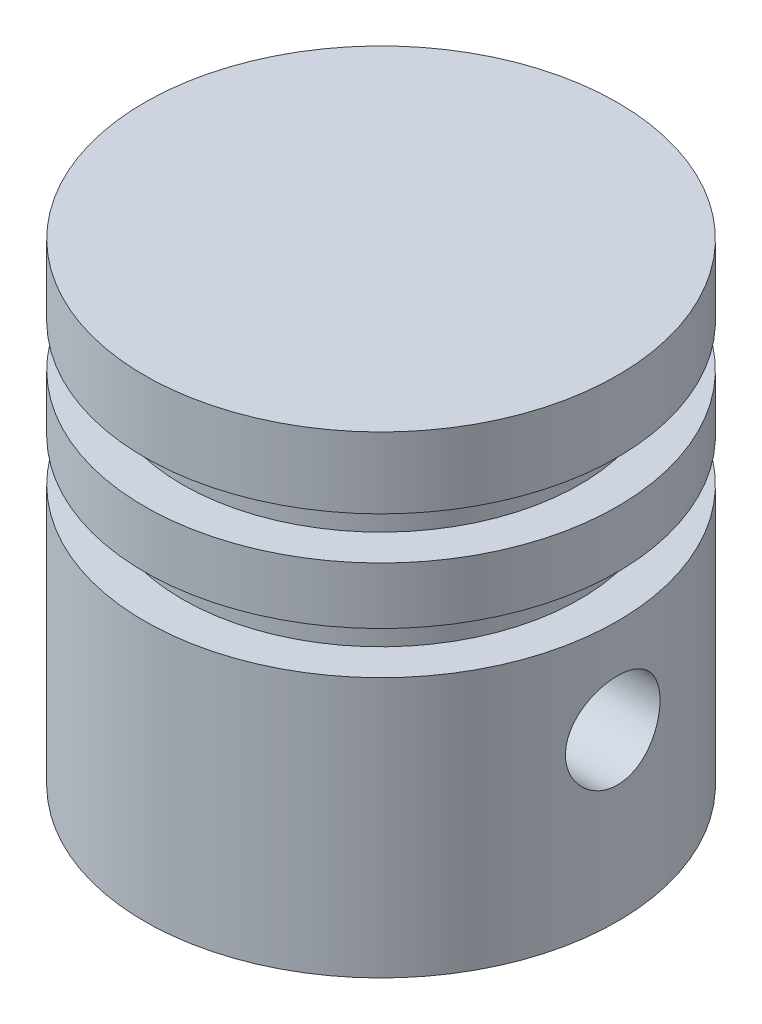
ISO-10303-21;
HEADER;
FILE_DESCRIPTION(('STEP AP214'),'2;1');
FILE_NAME('part.step','',(''),(''),'','','');
FILE_SCHEMA(('AUTOMOTIVE_DESIGN { 1 0 10303 214 1 1 1 1 }'));
ENDSEC;
DATA;
#1=APPLICATION_CONTEXT('core data for automotive mechanical design processes');
#2=APPLICATION_PROTOCOL_DEFINITION('international standard','automotive_design',2000,#1);
#3=PRODUCT_CONTEXT('',#1,'mechanical');
#4=PRODUCT('Part','Part','',(#3));
#5=PRODUCT_RELATED_PRODUCT_CATEGORY('part','',(#4));
#6=PRODUCT_DEFINITION_FORMATION('','',#4);
#7=PRODUCT_DEFINITION_CONTEXT('part definition',#1,'design');
#8=PRODUCT_DEFINITION('design','',#6,#7);
#9=PRODUCT_DEFINITION_SHAPE('','',#8);
#10=(LENGTH_UNIT() NAMED_UNIT(*) SI_UNIT(.MILLI.,.METRE.));
#11=(NAMED_UNIT(*) PLANE_ANGLE_UNIT() SI_UNIT($,.RADIAN.));
#12=(NAMED_UNIT(*) SI_UNIT($,.STERADIAN.) SOLID_ANGLE_UNIT());
#13=UNCERTAINTY_MEASURE_WITH_UNIT(LENGTH_MEASURE(1.E-05),#10,'distance_accuracy_value','');
#14=(GEOMETRIC_REPRESENTATION_CONTEXT(3) GLOBAL_UNCERTAINTY_ASSIGNED_CONTEXT((#13)) GLOBAL_UNIT_ASSIGNED_CONTEXT((#10,
#11,#12)) REPRESENTATION_CONTEXT('',''));
#15=CARTESIAN_POINT('',(0.,0.,0.));
#16=DIRECTION('',(0.,0.,1.));
#17=DIRECTION('',(1.,0.,0.));
#18=AXIS2_PLACEMENT_3D('',#15,#16,#17);
#19=CARTESIAN_POINT('',(-500000.,35.,0.));
#20=DIRECTION('',(1.,0.,0.));
#21=DIRECTION('',(0.,0.,-1.));
#22=AXIS2_PLACEMENT_3D('',#19,#20,#21);
#23=CYLINDRICAL_SURFACE('',#22,15.);
#24=CARTESIAN_POINT('',(-25.6672688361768,35.,-15.));
#25=CARTESIAN_POINT('',(-25.6672707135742,35.3904362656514,-14.999998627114));
#26=CARTESIAN_POINT('',(-25.6762078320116,35.7808998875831,-14.9847358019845));
#27=CARTESIAN_POINT('',(-25.7116213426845,36.5588071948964,-14.9238878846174));
#28=CARTESIAN_POINT('',(-25.7381056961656,36.9462494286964,-14.8782890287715));
#29=CARTESIAN_POINT('',(-25.8076793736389,37.7156387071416,-14.7572774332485));
#30=CARTESIAN_POINT('',(-25.8507985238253,38.0975745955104,-14.6818111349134));
#31=CARTESIAN_POINT('',(-25.9520791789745,38.8524887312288,-14.502030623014));
#32=CARTESIAN_POINT('',(-26.0102392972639,39.2254678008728,-14.3977190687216));
#33=CARTESIAN_POINT('',(-26.1392976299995,39.9581832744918,-14.1620525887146));
#34=CARTESIAN_POINT('',(-26.2101248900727,40.3179806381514,-14.0308477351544));
#35=CARTESIAN_POINT('',(-26.3625643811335,41.0245454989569,-13.7422885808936));
#36=CARTESIAN_POINT('',(-26.4441768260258,41.3713127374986,-13.5849337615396));
#37=CARTESIAN_POINT('',(-26.6158847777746,42.0501394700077,-13.2453592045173));
#38=CARTESIAN_POINT('',(-26.7059784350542,42.3822021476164,-13.0631448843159));
#39=CARTESIAN_POINT('',(-26.8923867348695,43.0304546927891,-12.6749593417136));
#40=CARTESIAN_POINT('',(-26.988703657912,43.346638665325,-12.4689793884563));
#41=CARTESIAN_POINT('',(-27.1934993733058,43.9876328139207,-12.0162004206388));
#42=CARTESIAN_POINT('',(-27.3023204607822,44.3109400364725,-11.7674264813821));
#43=CARTESIAN_POINT('',(-27.5217235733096,44.9359050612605,-11.2447214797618));
#44=CARTESIAN_POINT('',(-27.6323056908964,45.2375617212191,-10.9707890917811));
#45=CARTESIAN_POINT('',(-27.8525619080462,45.8179785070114,-10.3989143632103));
#46=CARTESIAN_POINT('',(-27.962235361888,46.0967234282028,-10.100956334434));
#47=CARTESIAN_POINT('',(-28.1779156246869,46.6295123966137,-9.48266450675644));
#48=CARTESIAN_POINT('',(-28.2839236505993,46.8835646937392,-9.16233824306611));
#49=CARTESIAN_POINT('',(-28.496911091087,47.3822274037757,-8.47773360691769));
#50=CARTESIAN_POINT('',(-28.6034486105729,47.6249630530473,-8.11194772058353));
#51=CARTESIAN_POINT('',(-28.8065084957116,48.0785078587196,-7.35839755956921));
#52=CARTESIAN_POINT('',(-28.90303027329,48.289315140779,-6.97063199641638));
#53=CARTESIAN_POINT('',(-29.0832343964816,48.6768142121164,-6.17576933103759));
#54=CARTESIAN_POINT('',(-29.1669230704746,48.8535228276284,-5.76868188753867));
#55=CARTESIAN_POINT('',(-29.3189993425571,49.1709015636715,-4.93793464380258));
#56=CARTESIAN_POINT('',(-29.3873886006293,49.3115755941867,-4.51427664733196));
#57=CARTESIAN_POINT('',(-29.5024166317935,49.5462563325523,-3.68490478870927));
#58=CARTESIAN_POINT('',(-29.5502695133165,49.6428996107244,-3.28010464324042));
#59=CARTESIAN_POINT('',(-29.6296207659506,49.8023827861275,-2.46231162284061));
#60=CARTESIAN_POINT('',(-29.6611198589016,49.8652241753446,-2.0493191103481));
#61=CARTESIAN_POINT('',(-29.7068360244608,49.9562350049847,-1.2187953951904));
#62=CARTESIAN_POINT('',(-29.7210620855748,49.9844224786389,-0.801266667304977));
#63=CARTESIAN_POINT('',(-29.73183897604,50.0057873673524,0.0349029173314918));
#64=CARTESIAN_POINT('',(-29.7283909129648,49.9989669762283,0.453543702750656));
#65=CARTESIAN_POINT('',(-29.7050158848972,49.9525788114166,1.25123457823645));
#66=CARTESIAN_POINT('',(-29.6865766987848,49.9159673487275,1.63050471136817));
#67=CARTESIAN_POINT('',(-29.6355681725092,49.8141876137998,2.38420398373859));
#68=CARTESIAN_POINT('',(-29.602999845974,49.7490213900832,2.75863346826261));
#69=CARTESIAN_POINT('',(-29.5245114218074,49.5908462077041,3.50013393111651));
#70=CARTESIAN_POINT('',(-29.4785908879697,49.4978363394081,3.86720466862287));
#71=CARTESIAN_POINT('',(-29.3744648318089,49.2849260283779,4.59167176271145));
#72=CARTESIAN_POINT('',(-29.3162588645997,49.1650246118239,4.94906776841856));
#73=CARTESIAN_POINT('',(-29.1880024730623,48.8976523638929,5.65688278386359));
#74=CARTESIAN_POINT('',(-29.1178022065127,48.7498298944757,6.00714157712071));
#75=CARTESIAN_POINT('',(-28.9676748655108,48.428983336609,6.69372891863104));
#76=CARTESIAN_POINT('',(-28.8877478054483,48.2559592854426,7.03005748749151));
#77=CARTESIAN_POINT('',(-28.7198605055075,47.8859950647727,7.68721884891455));
#78=CARTESIAN_POINT('',(-28.6318995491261,47.6890527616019,8.00805025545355));
#79=CARTESIAN_POINT('',(-28.4497328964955,47.272477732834,8.6329231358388));
#80=CARTESIAN_POINT('',(-28.3555247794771,47.0528361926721,8.93695801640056));
#81=CARTESIAN_POINT('',(-28.1535731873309,46.5701144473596,9.55513443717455));
#82=CARTESIAN_POINT('',(-28.0453969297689,46.3048888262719,9.86746138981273));
#83=CARTESIAN_POINT('',(-27.8264742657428,45.7502972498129,10.4689288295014));
#84=CARTESIAN_POINT('',(-27.7157277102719,45.4609298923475,10.7580679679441));
#85=CARTESIAN_POINT('',(-27.4943042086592,44.8593276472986,11.3119826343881));
#86=CARTESIAN_POINT('',(-27.3836273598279,44.547077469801,11.5767416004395));
#87=CARTESIAN_POINT('',(-27.165218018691,43.9012767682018,12.080355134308));
#88=CARTESIAN_POINT('',(-27.0574860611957,43.5677224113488,12.3192050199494));
#89=CARTESIAN_POINT('',(-26.8409825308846,42.858190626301,12.7843825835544));
#90=CARTESIAN_POINT('',(-26.7326103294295,42.4808660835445,13.0088476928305));
#91=CARTESIAN_POINT('',(-26.526193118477,41.7059371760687,13.4247410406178));
#92=CARTESIAN_POINT('',(-26.4281434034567,41.3083421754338,13.6161843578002));
#93=CARTESIAN_POINT('',(-26.2459611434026,40.4953238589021,13.9641250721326));
#94=CARTESIAN_POINT('',(-26.1618202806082,40.0799113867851,14.1206433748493));
#95=CARTESIAN_POINT('',(-26.0108112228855,39.2339879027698,14.3969175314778));
#96=CARTESIAN_POINT('',(-25.943940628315,38.8034789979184,14.5166784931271));
#97=CARTESIAN_POINT('',(-25.8349668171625,37.9656924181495,14.7096723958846));
#98=CARTESIAN_POINT('',(-25.7913154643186,37.5592944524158,14.7858508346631));
#99=CARTESIAN_POINT('',(-25.7229432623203,36.7400187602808,14.9044827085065));
#100=CARTESIAN_POINT('',(-25.6982213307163,36.3271414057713,14.9469380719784));
#101=CARTESIAN_POINT('',(-25.6687811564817,35.4988341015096,14.9974405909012));
#102=CARTESIAN_POINT('',(-25.6640503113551,35.0834059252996,15.0055094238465));
#103=CARTESIAN_POINT('',(-25.6747686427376,34.2535907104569,14.9871634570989));
#104=CARTESIAN_POINT('',(-25.6902163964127,33.8392036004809,14.9607510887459));
#105=CARTESIAN_POINT('',(-25.7377646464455,33.0616700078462,14.8787793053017));
#106=CARTESIAN_POINT('',(-25.767794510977,32.6980070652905,14.8268361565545));
#107=CARTESIAN_POINT('',(-25.8421959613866,31.9769240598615,14.6967754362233));
#108=CARTESIAN_POINT('',(-25.8865662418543,31.6195034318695,14.6186602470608));
#109=CARTESIAN_POINT('',(-25.9882701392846,30.9129741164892,14.4370811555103));
#110=CARTESIAN_POINT('',(-26.0456070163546,30.5638675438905,14.3336108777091));
#111=CARTESIAN_POINT('',(-26.1715605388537,29.8759112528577,14.1023200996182));
#112=CARTESIAN_POINT('',(-26.2401778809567,29.5370621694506,13.9744980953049));
#113=CARTESIAN_POINT('',(-26.390207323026,28.8559178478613,13.689148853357));
#114=CARTESIAN_POINT('',(-26.4720623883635,28.5141793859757,13.5305267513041));
#115=CARTESIAN_POINT('',(-26.643890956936,27.8450822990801,13.1889466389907));
#116=CARTESIAN_POINT('',(-26.7338673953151,27.5177289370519,13.0059798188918));
#117=CARTESIAN_POINT('',(-26.9196983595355,26.8787342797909,12.6168545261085));
#118=CARTESIAN_POINT('',(-27.015554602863,26.5670976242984,12.410689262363));
#119=CARTESIAN_POINT('',(-27.2108975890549,25.9608286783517,11.9763286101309));
#120=CARTESIAN_POINT('',(-27.3103841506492,25.666195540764,11.7481343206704));
#121=CARTESIAN_POINT('',(-27.5237769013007,25.0581292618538,11.2399201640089));
#122=CARTESIAN_POINT('',(-27.6378873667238,24.7471754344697,10.9570123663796));
#123=CARTESIAN_POINT('',(-27.8649847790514,24.1498849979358,10.3658847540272));
#124=CARTESIAN_POINT('',(-27.9779716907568,23.8635491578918,10.0576641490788));
#125=CARTESIAN_POINT('',(-28.1999954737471,23.3169583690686,9.41721103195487));
#126=CARTESIAN_POINT('',(-28.3090299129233,23.0567193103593,9.08496409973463));
#127=CARTESIAN_POINT('',(-28.5202442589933,22.5643626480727,8.39840957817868));
#128=CARTESIAN_POINT('',(-28.6224271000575,22.332232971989,8.04411155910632));
#129=CARTESIAN_POINT('',(-28.8201315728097,21.8915605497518,7.30474264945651));
#130=CARTESIAN_POINT('',(-28.9153788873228,21.6838829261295,6.91908126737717));
#131=CARTESIAN_POINT('',(-29.0931722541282,21.302097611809,6.12862935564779));
#132=CARTESIAN_POINT('',(-29.1757178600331,21.1279911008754,5.72383815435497));
#133=CARTESIAN_POINT('',(-29.3256057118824,20.8154570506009,4.89830374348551));
#134=CARTESIAN_POINT('',(-29.3929589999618,20.6770035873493,4.47757238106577));
#135=CARTESIAN_POINT('',(-29.5104450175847,20.4374248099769,3.62327653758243));
#136=CARTESIAN_POINT('',(-29.5605798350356,20.3362949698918,3.18971361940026));
#137=CARTESIAN_POINT('',(-29.6382400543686,20.1803950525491,2.35430446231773));
#138=CARTESIAN_POINT('',(-29.6674324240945,20.12219252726,1.95325076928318));
#139=CARTESIAN_POINT('',(-29.709531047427,20.0384201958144,1.14690518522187));
#140=CARTESIAN_POINT('',(-29.7224383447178,20.0128482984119,0.741613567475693));
#141=CARTESIAN_POINT('',(-29.7316059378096,19.994675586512,-0.0697679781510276));
#142=CARTESIAN_POINT('',(-29.7278713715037,20.0020645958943,-0.475857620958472));
#143=CARTESIAN_POINT('',(-29.7038710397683,20.0496925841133,-1.28560540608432));
#144=CARTESIAN_POINT('',(-29.6836057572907,20.0899306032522,-1.68926361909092));
#145=CARTESIAN_POINT('',(-29.6290334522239,20.1988858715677,-2.46360596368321));
#146=CARTESIAN_POINT('',(-29.5957750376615,20.2654803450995,-2.83466573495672));
#147=CARTESIAN_POINT('',(-29.5161796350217,20.4260153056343,-3.56936212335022));
#148=CARTESIAN_POINT('',(-29.4698434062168,20.5199542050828,-3.9329991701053));
#149=CARTESIAN_POINT('',(-29.3651450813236,20.7342441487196,-4.65064153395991));
#150=CARTESIAN_POINT('',(-29.3067820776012,20.8545971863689,-5.00464612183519));
#151=CARTESIAN_POINT('',(-29.1793151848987,21.1206135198,-5.70101523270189));
#152=CARTESIAN_POINT('',(-29.1102107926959,21.2662780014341,-6.04337920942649));
#153=CARTESIAN_POINT('',(-28.9596112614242,21.5883815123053,-6.7288850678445));
#154=CARTESIAN_POINT('',(-28.8777164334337,21.7658594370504,-7.07145066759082));
#155=CARTESIAN_POINT('',(-28.7056611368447,22.1456255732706,-7.74034819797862));
#156=CARTESIAN_POINT('',(-28.615500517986,22.3479142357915,-8.06667983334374));
#157=CARTESIAN_POINT('',(-28.4288271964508,22.7759814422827,-8.70172598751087));
#158=CARTESIAN_POINT('',(-28.3323131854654,23.0017648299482,-9.01043685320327));
#159=CARTESIAN_POINT('',(-28.1349461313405,23.4755521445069,-9.60899878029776));
#160=CARTESIAN_POINT('',(-28.0340915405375,23.7235640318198,-9.89884302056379));
#161=CARTESIAN_POINT('',(-27.8198798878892,24.2666212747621,-10.4866796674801));
#162=CARTESIAN_POINT('',(-27.7062887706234,24.5638870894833,-10.7825391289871));
#163=CARTESIAN_POINT('',(-27.4793583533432,25.1822024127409,-11.3484145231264));
#164=CARTESIAN_POINT('',(-27.3660190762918,25.5032540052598,-11.6184281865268));
#165=CARTESIAN_POINT('',(-27.1425096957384,26.167944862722,-12.1314149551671));
#166=CARTESIAN_POINT('',(-27.0323432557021,26.5116088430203,-12.3743576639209));
#167=CARTESIAN_POINT('',(-26.8185025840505,27.2194379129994,-12.831220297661));
#168=CARTESIAN_POINT('',(-26.7148257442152,27.5835946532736,-13.0451519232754));
#169=CARTESIAN_POINT('',(-26.5136861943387,28.3437411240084,-13.4493821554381));
#170=CARTESIAN_POINT('',(-26.4165645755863,28.7403972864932,-13.638601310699));
#171=CARTESIAN_POINT('',(-26.2361869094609,29.5515934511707,-13.9824507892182));
#172=CARTESIAN_POINT('',(-26.1529331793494,29.9661364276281,-14.1370753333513));
#173=CARTESIAN_POINT('',(-26.003896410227,30.8088911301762,-14.4093760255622));
#174=CARTESIAN_POINT('',(-25.9380628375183,31.2370591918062,-14.5271592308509));
#175=CARTESIAN_POINT('',(-25.8265042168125,32.1044391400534,-14.7245818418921));
#176=CARTESIAN_POINT('',(-25.7807652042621,32.5436431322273,-14.8042477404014));
#177=CARTESIAN_POINT('',(-25.7200944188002,33.3192521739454,-14.9093277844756));
#178=CARTESIAN_POINT('',(-25.7003363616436,33.6541495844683,-14.9432951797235));
#179=CARTESIAN_POINT('',(-25.6739223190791,34.3260244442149,-14.9886326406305));
#180=CARTESIAN_POINT('',(-25.6672672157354,34.6630020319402,-15.0000011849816));
#181=CARTESIAN_POINT('',(-25.6672688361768,35.,-15.));
#182=B_SPLINE_CURVE_WITH_KNOTS('',3,(#24,#25,#26,#27,#28,#29,#30,#31,#32,#33,#34,#35,#36,#37,
#38,#39,#40,#41,#42,#43,#44,#45,#46,#47,#48,#49,#50,#51,#52,#53,#54,#55,#56,#57,#58,#59,#60,#61,
#62,#63,#64,#65,#66,#67,#68,#69,#70,#71,#72,#73,#74,#75,#76,#77,#78,#79,#80,#81,#82,#83,#84,#85,
#86,#87,#88,#89,#90,#91,#92,#93,#94,#95,#96,#97,#98,#99,#100,#101,#102,#103,#104,#105,#106,#107,
#108,#109,#110,#111,#112,#113,#114,#115,#116,#117,#118,#119,#120,#121,#122,#123,#124,#125,#126,
#127,#128,#129,#130,#131,#132,#133,#134,#135,#136,#137,#138,#139,#140,#141,#142,#143,#144,#145,
#146,#147,#148,#149,#150,#151,#152,#153,#154,#155,#156,#157,#158,#159,#160,#161,#162,#163,#164,
#165,#166,#167,#168,#169,#170,#171,#172,#173,#174,#175,#176,#177,#178,#179,#180,#181),
.UNSPECIFIED.,.T.,.F.,(4,2,2,2,2,2,2,2,2,2,2,2,2,2,2,2,2,2,2,2,2,2,2,2,2,2,2,2,2,2,2,2,2,2,2,2,
2,2,2,2,2,2,2,2,2,2,2,2,2,2,2,2,2,2,2,2,2,2,2,2,2,2,2,2,2,2,2,2,2,2,2,2,2,2,2,2,2,2,4),(0.,
1.1709600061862,2.34245164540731,3.51605360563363,4.68954740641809,5.85666284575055,
7.02380143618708,8.19068608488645,9.35800078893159,10.6232796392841,11.8886251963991,
13.154803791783,14.4205578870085,15.7740388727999,17.127599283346,18.4804900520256,
19.8332339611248,21.0882840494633,22.343278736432,23.5976200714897,24.8518828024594,
25.9949678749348,27.1379709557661,28.2810113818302,29.4240932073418,30.5826678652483,
31.7412408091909,32.8999171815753,34.059045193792,35.3290365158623,36.5991016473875,
37.8700232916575,39.1411742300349,40.4960961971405,41.8503978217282,43.2038865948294,
44.5571872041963,45.802730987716,47.0482035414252,48.2928908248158,49.5374903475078,
50.6419680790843,51.7463452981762,52.8510004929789,53.955723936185,55.1111966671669,
56.2670886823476,57.4233199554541,58.5794935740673,59.8848443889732,61.1902359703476,
62.4964176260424,63.8020362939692,65.1450191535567,66.4880491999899,67.8300999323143,
69.1719878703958,70.3892914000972,71.6065169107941,72.8233666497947,74.0401808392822,
75.1742470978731,76.3082475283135,77.4423335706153,78.5764727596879,79.7584489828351,
80.9404466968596,82.1226885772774,83.3053555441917,84.607453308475,85.9096652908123,
87.2133250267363,88.5164574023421,89.8648691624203,91.2135060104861,92.5581866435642,
93.9019313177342,94.9125561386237,95.9232489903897),.UNSPECIFIED.);
#183=CARTESIAN_POINT('',(-25.6672688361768,35.,-15.));
#184=VERTEX_POINT('',#183);
#185=EDGE_CURVE('E13',#184,#184,#182,.T.);
#186=ORIENTED_EDGE('',*,*,#185,.T.);
#187=EDGE_LOOP('',(#186));
#188=FACE_BOUND('',#187,.T.);
#189=CARTESIAN_POINT('',(-10.,35.,0.));
#190=DIRECTION('',(1.,0.,0.));
#191=DIRECTION('',(0.,0.,-1.));
#192=AXIS2_PLACEMENT_3D('',#189,#190,#191);
#193=CIRCLE('',#192,15.);
#194=CARTESIAN_POINT('',(-10.,35.,-15.));
#195=VERTEX_POINT('',#194);
#196=EDGE_CURVE('E114',#195,#195,#193,.T.);
#197=ORIENTED_EDGE('',*,*,#196,.F.);
#198=EDGE_LOOP('',(#197));
#199=FACE_BOUND('',#198,.T.);
#200=ADVANCED_FACE('F55',(#188,#199),#23,.T.);
#201=CARTESIAN_POINT('',(-500000.,35.,0.));
#202=DIRECTION('',(1.,0.,0.));
#203=DIRECTION('',(0.,0.,-1.));
#204=AXIS2_PLACEMENT_3D('',#201,#202,#203);
#205=CYLINDRICAL_SURFACE('',#204,10.);
#206=CARTESIAN_POINT('',(-50.,25.,0.));
#207=CARTESIAN_POINT('',(-50.0000028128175,24.9999944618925,0.277977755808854));
#208=CARTESIAN_POINT('',(-49.9976778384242,25.011593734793,0.555886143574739));
#209=CARTESIAN_POINT('',(-49.9884489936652,25.0578879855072,1.10977921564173));
#210=CARTESIAN_POINT('',(-49.9815443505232,25.0925868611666,1.38576356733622));
#211=CARTESIAN_POINT('',(-49.963338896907,25.1848451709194,1.93392208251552));
#212=CARTESIAN_POINT('',(-49.9520350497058,25.2424203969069,2.20609347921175));
#213=CARTESIAN_POINT('',(-49.9253471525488,25.379977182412,2.74451501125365));
#214=CARTESIAN_POINT('',(-49.9099630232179,25.4599591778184,3.01076503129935));
#215=CARTESIAN_POINT('',(-49.875557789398,25.6416238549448,3.53521359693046));
#216=CARTESIAN_POINT('',(-49.8565402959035,25.7432850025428,3.79341984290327));
#217=CARTESIAN_POINT('',(-49.8153808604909,25.9675961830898,4.30028962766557));
#218=CARTESIAN_POINT('',(-49.7932388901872,26.0902464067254,4.54895307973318));
#219=CARTESIAN_POINT('',(-49.7464407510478,26.3556138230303,5.03500105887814));
#220=CARTESIAN_POINT('',(-49.7217851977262,26.4983261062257,5.27238832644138));
#221=CARTESIAN_POINT('',(-49.6706164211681,26.8028865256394,5.73445047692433));
#222=CARTESIAN_POINT('',(-49.6441025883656,26.9647409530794,5.95912114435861));
#223=CARTESIAN_POINT('',(-49.5896179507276,27.3084890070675,6.39679707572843));
#224=CARTESIAN_POINT('',(-49.5616335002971,27.490599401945,6.60963041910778));
#225=CARTESIAN_POINT('',(-49.5052811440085,27.8719972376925,7.01925151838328));
#226=CARTESIAN_POINT('',(-49.4769132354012,28.0712848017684,7.21603915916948));
#227=CARTESIAN_POINT('',(-49.4205766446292,28.485742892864,7.59228605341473));
#228=CARTESIAN_POINT('',(-49.3926080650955,28.7009174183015,7.77174091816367));
#229=CARTESIAN_POINT('',(-49.3378715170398,29.1455810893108,8.11197405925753));
#230=CARTESIAN_POINT('',(-49.3111031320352,29.3750652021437,8.27275884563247));
#231=CARTESIAN_POINT('',(-49.2592741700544,29.8490688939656,8.57600136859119));
#232=CARTESIAN_POINT('',(-49.2342317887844,30.0937084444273,8.71827477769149));
#233=CARTESIAN_POINT('',(-49.1868624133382,30.5943753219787,8.98167482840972));
#234=CARTESIAN_POINT('',(-49.1645354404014,30.8504027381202,9.10280130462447));
#235=CARTESIAN_POINT('',(-49.1232596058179,31.3720234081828,9.32297805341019));
#236=CARTESIAN_POINT('',(-49.1043104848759,31.6376159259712,9.42203002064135));
#237=CARTESIAN_POINT('',(-49.0703574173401,32.1764793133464,9.59729126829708));
#238=CARTESIAN_POINT('',(-49.0553534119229,32.4497500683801,9.67350088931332));
#239=CARTESIAN_POINT('',(-49.0299142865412,32.9983544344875,9.80161813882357));
#240=CARTESIAN_POINT('',(-49.019421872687,33.2736140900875,9.85383113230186));
#241=CARTESIAN_POINT('',(-49.0030373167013,33.8276783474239,9.93499133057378));
#242=CARTESIAN_POINT('',(-48.9971451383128,34.1064829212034,9.96393871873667));
#243=CARTESIAN_POINT('',(-48.9901389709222,34.6655728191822,9.99832951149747));
#244=CARTESIAN_POINT('',(-48.9890245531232,34.945858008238,10.0037750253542));
#245=CARTESIAN_POINT('',(-48.9916064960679,35.5058728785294,9.99112280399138));
#246=CARTESIAN_POINT('',(-48.9953028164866,35.7856025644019,9.97302526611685));
#247=CARTESIAN_POINT('',(-49.0073028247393,36.3382453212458,9.91388721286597));
#248=CARTESIAN_POINT('',(-49.015536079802,36.6111975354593,9.87319735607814));
#249=CARTESIAN_POINT('',(-49.0363201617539,37.1526452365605,9.76944726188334));
#250=CARTESIAN_POINT('',(-49.0488709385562,37.4211407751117,9.70638728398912));
#251=CARTESIAN_POINT('',(-49.0779254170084,37.9517693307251,9.55839501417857));
#252=CARTESIAN_POINT('',(-49.0944285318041,38.2139032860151,9.47346596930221));
#253=CARTESIAN_POINT('',(-49.1309243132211,38.7301547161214,9.28233469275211));
#254=CARTESIAN_POINT('',(-49.1509182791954,38.9842691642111,9.17612453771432));
#255=CARTESIAN_POINT('',(-49.193968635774,39.4843071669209,8.94246310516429));
#256=CARTESIAN_POINT('',(-49.2170442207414,39.7301661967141,8.81487730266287));
#257=CARTESIAN_POINT('',(-49.2655065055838,40.2102964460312,8.53986851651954));
#258=CARTESIAN_POINT('',(-49.2908932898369,40.444567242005,8.39244480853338));
#259=CARTESIAN_POINT('',(-49.3432736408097,40.8999858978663,8.07877597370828));
#260=CARTESIAN_POINT('',(-49.3702673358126,41.1211327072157,7.91252934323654));
#261=CARTESIAN_POINT('',(-49.4251177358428,41.5488361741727,7.56234993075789));
#262=CARTESIAN_POINT('',(-49.452974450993,41.7553926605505,7.37841694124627));
#263=CARTESIAN_POINT('',(-49.5092950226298,42.1561418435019,6.9906203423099));
#264=CARTESIAN_POINT('',(-49.5377607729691,42.3500446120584,6.78645727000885));
#265=CARTESIAN_POINT('',(-49.593999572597,42.7199888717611,6.36246248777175));
#266=CARTESIAN_POINT('',(-49.6217726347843,42.8960306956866,6.14263106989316));
#267=CARTESIAN_POINT('',(-49.6758545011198,43.2290663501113,5.68873593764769));
#268=CARTESIAN_POINT('',(-49.7021629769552,43.386055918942,5.45466905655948));
#269=CARTESIAN_POINT('',(-49.7525608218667,43.6797603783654,4.97403719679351));
#270=CARTESIAN_POINT('',(-49.7766510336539,43.8164829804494,4.72747701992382));
#271=CARTESIAN_POINT('',(-49.8219853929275,44.0689406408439,4.22303258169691));
#272=CARTESIAN_POINT('',(-49.8432244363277,44.1846381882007,3.96512908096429));
#273=CARTESIAN_POINT('',(-49.8822025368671,44.393865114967,3.44022135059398));
#274=CARTESIAN_POINT('',(-49.8999415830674,44.4873944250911,3.1732170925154));
#275=CARTESIAN_POINT('',(-49.9314104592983,44.6515410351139,2.63205201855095));
#276=CARTESIAN_POINT('',(-49.9451406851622,44.7221605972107,2.35789191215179));
#277=CARTESIAN_POINT('',(-49.9681986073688,44.8399294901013,1.80439488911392));
#278=CARTESIAN_POINT('',(-49.977526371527,44.8870791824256,1.52505805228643));
#279=CARTESIAN_POINT('',(-49.9913926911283,44.9569319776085,0.967980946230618));
#280=CARTESIAN_POINT('',(-49.996008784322,44.9800310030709,0.690292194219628));
#281=CARTESIAN_POINT('',(-50.0005945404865,45.0029786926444,0.13391864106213));
#282=CARTESIAN_POINT('',(-50.0005642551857,45.0028276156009,-0.144766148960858));
#283=CARTESIAN_POINT('',(-49.995858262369,44.9792772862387,-0.701096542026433));
#284=CARTESIAN_POINT('',(-49.991182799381,44.9558792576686,-0.978742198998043));
#285=CARTESIAN_POINT('',(-49.977318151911,44.8860254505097,-1.53100232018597));
#286=CARTESIAN_POINT('',(-49.968128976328,44.8395697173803,-1.80561679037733));
#287=CARTESIAN_POINT('',(-49.9455964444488,44.724492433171,-2.34739156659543));
#288=CARTESIAN_POINT('',(-49.9322912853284,44.6560744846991,-2.61459675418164));
#289=CARTESIAN_POINT('',(-49.9018651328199,44.4974836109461,-3.14224372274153));
#290=CARTESIAN_POINT('',(-49.8847441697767,44.4073108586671,-3.40268555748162));
#291=CARTESIAN_POINT('',(-49.8471538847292,44.2058965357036,-3.91499921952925));
#292=CARTESIAN_POINT('',(-49.8266849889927,44.0946576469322,-4.16687213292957));
#293=CARTESIAN_POINT('',(-49.7829414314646,43.851865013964,-4.6604901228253));
#294=CARTESIAN_POINT('',(-49.75966570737,43.7203035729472,-4.90223131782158));
#295=CARTESIAN_POINT('',(-49.7106509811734,43.436150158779,-5.37668428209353));
#296=CARTESIAN_POINT('',(-49.6848860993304,43.2833278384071,-5.60925542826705));
#297=CARTESIAN_POINT('',(-49.6318230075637,42.9588612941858,-6.06084706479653));
#298=CARTESIAN_POINT('',(-49.6045241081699,42.7872085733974,-6.27986136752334));
#299=CARTESIAN_POINT('',(-49.5491477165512,42.4262932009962,-6.70279490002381));
#300=CARTESIAN_POINT('',(-49.5210701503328,42.2370288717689,-6.9067126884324));
#301=CARTESIAN_POINT('',(-49.4649210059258,41.8422624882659,-7.29798916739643));
#302=CARTESIAN_POINT('',(-49.4368494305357,41.6367676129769,-7.48535510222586));
#303=CARTESIAN_POINT('',(-49.3810380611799,41.2074878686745,-7.84517391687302));
#304=CARTESIAN_POINT('',(-49.353310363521,40.9834668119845,-8.01734702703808));
#305=CARTESIAN_POINT('',(-49.2994494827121,40.5216201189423,-8.34214485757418));
#306=CARTESIAN_POINT('',(-49.2733157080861,40.2837996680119,-8.4947768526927));
#307=CARTESIAN_POINT('',(-49.2233833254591,39.7958689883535,-8.77948955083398));
#308=CARTESIAN_POINT('',(-49.1995851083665,39.5457567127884,-8.91156681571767));
#309=CARTESIAN_POINT('',(-49.1550271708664,39.035021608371,-9.15415330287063));
#310=CARTESIAN_POINT('',(-49.1342674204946,38.7743988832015,-9.26466273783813));
#311=CARTESIAN_POINT('',(-49.0965031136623,38.245877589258,-9.46274286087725));
#312=CARTESIAN_POINT('',(-49.0794794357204,37.9780243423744,-9.55043080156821));
#313=CARTESIAN_POINT('',(-49.049557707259,37.435655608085,-9.70293434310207));
#314=CARTESIAN_POINT('',(-49.0366596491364,37.1611401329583,-9.76774998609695));
#315=CARTESIAN_POINT('',(-49.0153799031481,36.6074750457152,-9.87397956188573));
#316=CARTESIAN_POINT('',(-49.006997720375,36.3283259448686,-9.91539605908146));
#317=CARTESIAN_POINT('',(-48.9950031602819,35.7674260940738,-9.97449643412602));
#318=CARTESIAN_POINT('',(-48.9913907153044,35.4856753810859,-9.99218064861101));
#319=CARTESIAN_POINT('',(-48.9890670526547,34.9267932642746,-10.0035662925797));
#320=CARTESIAN_POINT('',(-48.9902680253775,34.6496708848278,-9.99769739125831));
#321=CARTESIAN_POINT('',(-48.9973383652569,34.0969312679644,-9.96298881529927));
#322=CARTESIAN_POINT('',(-49.0032076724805,33.8213140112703,-9.9341494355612));
#323=CARTESIAN_POINT('',(-49.0194416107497,33.2735573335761,-9.85373138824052));
#324=CARTESIAN_POINT('',(-49.0298061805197,33.0014178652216,-9.80215303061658));
#325=CARTESIAN_POINT('',(-49.0547273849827,32.4625348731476,-9.6766630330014));
#326=CARTESIAN_POINT('',(-49.0692840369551,32.1957913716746,-9.60275130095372));
#327=CARTESIAN_POINT('',(-49.1021245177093,31.6702492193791,-9.43338650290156));
#328=CARTESIAN_POINT('',(-49.1203984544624,31.4114315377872,-9.33799053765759));
#329=CARTESIAN_POINT('',(-49.1601842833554,30.9026759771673,-9.12621961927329));
#330=CARTESIAN_POINT('',(-49.1816973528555,30.6527413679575,-9.00983703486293));
#331=CARTESIAN_POINT('',(-49.2273493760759,30.1635514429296,-8.75697253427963));
#332=CARTESIAN_POINT('',(-49.2514879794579,29.9242947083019,-8.62049329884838));
#333=CARTESIAN_POINT('',(-49.3017256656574,29.4579880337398,-8.3283733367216));
#334=CARTESIAN_POINT('',(-49.3278248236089,29.2309385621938,-8.17273187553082));
#335=CARTESIAN_POINT('',(-49.3817232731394,28.7867870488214,-7.84054768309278));
#336=CARTESIAN_POINT('',(-49.4095439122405,28.5699194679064,-7.66369484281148));
#337=CARTESIAN_POINT('',(-49.465694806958,28.1517963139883,-7.29248007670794));
#338=CARTESIAN_POINT('',(-49.4940250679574,27.9505409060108,-7.0981179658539));
#339=CARTESIAN_POINT('',(-49.5504141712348,27.5649520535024,-6.69314940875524));
#340=CARTESIAN_POINT('',(-49.5784729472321,27.3806226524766,-6.48253910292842));
#341=CARTESIAN_POINT('',(-49.6335340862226,27.0302035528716,-6.04653350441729));
#342=CARTESIAN_POINT('',(-49.6605364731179,26.8641134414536,-5.82113854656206));
#343=CARTESIAN_POINT('',(-49.7130171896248,26.5496521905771,-5.35458685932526));
#344=CARTESIAN_POINT('',(-49.7384761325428,26.401489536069,-5.11328734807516));
#345=CARTESIAN_POINT('',(-49.7868208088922,26.126111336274,-4.61888962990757));
#346=CARTESIAN_POINT('',(-49.8097074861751,25.9988880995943,-4.36579579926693));
#347=CARTESIAN_POINT('',(-49.8522536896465,25.7663509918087,-3.84964665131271));
#348=CARTESIAN_POINT('',(-49.8719151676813,25.6610238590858,-3.5865974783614));
#349=CARTESIAN_POINT('',(-49.907462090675,25.4730246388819,-3.05236884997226));
#350=CARTESIAN_POINT('',(-49.9233482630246,25.3903481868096,-2.78119097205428));
#351=CARTESIAN_POINT('',(-49.957617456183,25.2135537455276,-2.09840431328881));
#352=CARTESIAN_POINT('',(-49.97342838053,25.1335803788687,-1.68291498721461));
#353=CARTESIAN_POINT('',(-49.9946173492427,25.0268085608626,-0.844896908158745));
#354=CARTESIAN_POINT('',(-49.9999957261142,25.0000084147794,-0.422368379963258));
#355=CARTESIAN_POINT('',(-50.,25.,0.));
#356=B_SPLINE_CURVE_WITH_KNOTS('',3,(#206,#207,#208,#209,#210,#211,#212,#213,#214,#215,#216,
#217,#218,#219,#220,#221,#222,#223,#224,#225,#226,#227,#228,#229,#230,#231,#232,#233,#234,#235,
#236,#237,#238,#239,#240,#241,#242,#243,#244,#245,#246,#247,#248,#249,#250,#251,#252,#253,#254,
#255,#256,#257,#258,#259,#260,#261,#262,#263,#264,#265,#266,#267,#268,#269,#270,#271,#272,#273,
#274,#275,#276,#277,#278,#279,#280,#281,#282,#283,#284,#285,#286,#287,#288,#289,#290,#291,#292,
#293,#294,#295,#296,#297,#298,#299,#300,#301,#302,#303,#304,#305,#306,#307,#308,#309,#310,#311,
#312,#313,#314,#315,#316,#317,#318,#319,#320,#321,#322,#323,#324,#325,#326,#327,#328,#329,#330,
#331,#332,#333,#334,#335,#336,#337,#338,#339,#340,#341,#342,#343,#344,#345,#346,#347,#348,#349,
#350,#351,#352,#353,#354,#355),.UNSPECIFIED.,.T.,.F.,(4,2,2,2,2,2,2,2,2,2,2,2,2,2,2,2,2,2,2,2,2,
2,2,2,2,2,2,2,2,2,2,2,2,2,2,2,2,2,2,2,2,2,2,2,2,2,2,2,2,2,2,2,2,2,2,2,2,2,2,2,2,2,2,2,2,2,2,2,2,
2,2,2,2,2,4),(0.,0.833562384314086,1.66726546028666,2.50154505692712,3.33584088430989,
4.16931182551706,5.00279033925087,5.83606524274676,6.66961477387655,7.51314652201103,
8.35668432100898,9.2004351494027,10.0438908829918,10.8951899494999,11.7464956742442,
12.5977360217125,13.448963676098,14.2890369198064,15.1291035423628,15.9690947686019,
16.8090789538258,17.6363760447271,18.4636635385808,19.2908282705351,20.1183015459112,
20.9511927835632,21.7841144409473,22.6171026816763,23.4501006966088,24.2981118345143,
25.1461071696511,25.9942918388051,26.8421529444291,27.6915121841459,28.5408740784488,
29.3901520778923,30.2394169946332,31.0744689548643,31.9095116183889,32.7445103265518,
33.5795073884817,34.4069768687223,35.234439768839,36.061797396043,36.8894691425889,
37.7269307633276,38.564771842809,39.4026928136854,40.2402452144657,41.0909250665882,
41.9412873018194,42.7917916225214,43.6422875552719,44.4883234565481,45.3343577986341,
46.1802994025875,47.0262290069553,47.8567974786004,48.6873552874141,49.5179017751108,
50.3484516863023,51.1768196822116,52.005489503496,52.8340488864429,53.6626400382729,
54.5053049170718,55.3479787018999,56.1908532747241,57.0337087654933,57.8855779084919,
58.7371334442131,59.5881717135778,60.4390458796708,61.7056278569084,62.9721694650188),.UNSPECIFIED.);
#357=CARTESIAN_POINT('',(-50.,25.,0.));
#358=VERTEX_POINT('',#357);
#359=EDGE_CURVE('E128',#358,#358,#356,.T.);
#360=ORIENTED_EDGE('',*,*,#359,.T.);
#361=EDGE_LOOP('',(#360));
#362=FACE_BOUND('',#361,.T.);
#363=CARTESIAN_POINT('',(-9.99999999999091,35.,0.));
#364=DIRECTION('',(1.,0.,0.));
#365=DIRECTION('',(0.,0.,-1.));
#366=AXIS2_PLACEMENT_3D('',#363,#364,#365);
#367=CIRCLE('',#366,10.);
#368=CARTESIAN_POINT('',(-9.99999999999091,35.,-10.));
#369=VERTEX_POINT('',#368);
#370=EDGE_CURVE('E59',#369,#369,#367,.F.);
#371=ORIENTED_EDGE('',*,*,#370,.F.);
#372=EDGE_LOOP('',(#371));
#373=FACE_BOUND('',#372,.T.);
#374=ADVANCED_FACE('F105',(#362,#373),#205,.F.);
#375=CARTESIAN_POINT('',(0.,100.,0.));
#376=DIRECTION('',(0.,1.,0.));
#377=DIRECTION('',(0.,0.,1.));
#378=AXIS2_PLACEMENT_3D('',#375,#376,#377);
#379=PLANE('',#378);
#380=CARTESIAN_POINT('',(0.,100.,0.));
#381=DIRECTION('',(0.,-1.,0.));
#382=DIRECTION('',(0.,0.,-1.));
#383=AXIS2_PLACEMENT_3D('',#380,#381,#382);
#384=CIRCLE('',#383,50.);
#385=CARTESIAN_POINT('',(0.,100.,-50.));
#386=VERTEX_POINT('',#385);
#387=EDGE_CURVE('E68',#386,#386,#384,.T.);
#388=ORIENTED_EDGE('',*,*,#387,.F.);
#389=EDGE_LOOP('',(#388));
#390=FACE_BOUND('',#389,.T.);
#391=ADVANCED_FACE('F57',(#390),#379,.T.);
#392=CARTESIAN_POINT('',(0.,0.,0.));
#393=DIRECTION('',(0.,-1.,0.));
#394=DIRECTION('',(0.,0.,-1.));
#395=AXIS2_PLACEMENT_3D('',#392,#393,#394);
#396=CYLINDRICAL_SURFACE('',#395,50.);
#397=ORIENTED_EDGE('',*,*,#387,.T.);
#398=EDGE_LOOP('',(#397));
#399=FACE_BOUND('',#398,.T.);
#400=CARTESIAN_POINT('',(0.,85.,0.));
#401=DIRECTION('',(0.,-1.,0.));
#402=DIRECTION('',(0.,0.,-1.));
#403=AXIS2_PLACEMENT_3D('',#400,#401,#402);
#404=CIRCLE('',#403,50.);
#405=CARTESIAN_POINT('',(0.,85.,-50.));
#406=VERTEX_POINT('',#405);
#407=EDGE_CURVE('E299',#406,#406,#404,.T.);
#408=ORIENTED_EDGE('',*,*,#407,.F.);
#409=EDGE_LOOP('',(#408));
#410=FACE_BOUND('',#409,.T.);
#411=ADVANCED_FACE('F276',(#399,#410),#396,.T.);
#412=CARTESIAN_POINT('',(50.,85.,0.));
#413=DIRECTION('',(0.,-1.,0.));
#414=DIRECTION('',(0.,0.,-1.));
#415=AXIS2_PLACEMENT_3D('',#412,#413,#414);
#416=PLANE('',#415);
#417=ORIENTED_EDGE('',*,*,#407,.T.);
#418=EDGE_LOOP('',(#417));
#419=FACE_BOUND('',#418,.T.);
#420=CARTESIAN_POINT('',(0.,85.,0.));
#421=DIRECTION('',(0.,-1.,0.));
#422=DIRECTION('',(0.,0.,-1.));
#423=AXIS2_PLACEMENT_3D('',#420,#421,#422);
#424=CIRCLE('',#423,42.);
#425=CARTESIAN_POINT('',(0.,85.,-42.));
#426=VERTEX_POINT('',#425);
#427=EDGE_CURVE('E301',#426,#426,#424,.T.);
#428=ORIENTED_EDGE('',*,*,#427,.F.);
#429=EDGE_LOOP('',(#428));
#430=FACE_BOUND('',#429,.T.);
#431=ADVANCED_FACE('F266',(#419,#430),#416,.T.);
#432=CARTESIAN_POINT('',(0.,0.,0.));
#433=DIRECTION('',(0.,-1.,0.));
#434=DIRECTION('',(0.,0.,-1.));
#435=AXIS2_PLACEMENT_3D('',#432,#433,#434);
#436=CYLINDRICAL_SURFACE('',#435,42.);
#437=ORIENTED_EDGE('',*,*,#427,.T.);
#438=EDGE_LOOP('',(#437));
#439=FACE_BOUND('',#438,.T.);
#440=CARTESIAN_POINT('',(0.,76.,0.));
#441=DIRECTION('',(0.,-1.,0.));
#442=DIRECTION('',(0.,0.,-1.));
#443=AXIS2_PLACEMENT_3D('',#440,#441,#442);
#444=CIRCLE('',#443,42.);
#445=CARTESIAN_POINT('',(0.,76.,-42.));
#446=VERTEX_POINT('',#445);
#447=EDGE_CURVE('E306',#446,#446,#444,.T.);
#448=ORIENTED_EDGE('',*,*,#447,.F.);
#449=EDGE_LOOP('',(#448));
#450=FACE_BOUND('',#449,.T.);
#451=ADVANCED_FACE('F256',(#439,#450),#436,.T.);
#452=CARTESIAN_POINT('',(42.,76.,0.));
#453=DIRECTION('',(0.,1.,0.));
#454=DIRECTION('',(0.,0.,1.));
#455=AXIS2_PLACEMENT_3D('',#452,#453,#454);
#456=PLANE('',#455);
#457=ORIENTED_EDGE('',*,*,#447,.T.);
#458=EDGE_LOOP('',(#457));
#459=FACE_BOUND('',#458,.T.);
#460=CARTESIAN_POINT('',(0.,76.,0.));
#461=DIRECTION('',(0.,-1.,0.));
#462=DIRECTION('',(0.,0.,-1.));
#463=AXIS2_PLACEMENT_3D('',#460,#461,#462);
#464=CIRCLE('',#463,50.);
#465=CARTESIAN_POINT('',(0.,76.,-50.));
#466=VERTEX_POINT('',#465);
#467=EDGE_CURVE('E309',#466,#466,#464,.T.);
#468=ORIENTED_EDGE('',*,*,#467,.F.);
#469=EDGE_LOOP('',(#468));
#470=FACE_BOUND('',#469,.T.);
#471=ADVANCED_FACE('F246',(#459,#470),#456,.T.);
#472=CARTESIAN_POINT('',(0.,0.,0.));
#473=DIRECTION('',(0.,-1.,0.));
#474=DIRECTION('',(0.,0.,-1.));
#475=AXIS2_PLACEMENT_3D('',#472,#473,#474);
#476=CYLINDRICAL_SURFACE('',#475,50.);
#477=ORIENTED_EDGE('',*,*,#467,.T.);
#478=EDGE_LOOP('',(#477));
#479=FACE_BOUND('',#478,.T.);
#480=CARTESIAN_POINT('',(0.,64.,0.));
#481=DIRECTION('',(0.,-1.,0.));
#482=DIRECTION('',(0.,0.,-1.));
#483=AXIS2_PLACEMENT_3D('',#480,#481,#482);
#484=CIRCLE('',#483,50.);
#485=CARTESIAN_POINT('',(0.,64.,-50.));
#486=VERTEX_POINT('',#485);
#487=EDGE_CURVE('E312',#486,#486,#484,.T.);
#488=ORIENTED_EDGE('',*,*,#487,.F.);
#489=EDGE_LOOP('',(#488));
#490=FACE_BOUND('',#489,.T.);
#491=ADVANCED_FACE('F236',(#479,#490),#476,.T.);
#492=CARTESIAN_POINT('',(50.,64.,0.));
#493=DIRECTION('',(0.,-1.,0.));
#494=DIRECTION('',(0.,0.,-1.));
#495=AXIS2_PLACEMENT_3D('',#492,#493,#494);
#496=PLANE('',#495);
#497=ORIENTED_EDGE('',*,*,#487,.T.);
#498=EDGE_LOOP('',(#497));
#499=FACE_BOUND('',#498,.T.);
#500=CARTESIAN_POINT('',(0.,64.,0.));
#501=DIRECTION('',(0.,-1.,0.));
#502=DIRECTION('',(0.,0.,-1.));
#503=AXIS2_PLACEMENT_3D('',#500,#501,#502);
#504=CIRCLE('',#503,42.);
#505=CARTESIAN_POINT('',(0.,64.,-42.));
#506=VERTEX_POINT('',#505);
#507=EDGE_CURVE('E315',#506,#506,#504,.T.);
#508=ORIENTED_EDGE('',*,*,#507,.F.);
#509=EDGE_LOOP('',(#508));
#510=FACE_BOUND('',#509,.T.);
#511=ADVANCED_FACE('F226',(#499,#510),#496,.T.);
#512=CARTESIAN_POINT('',(0.,0.,0.));
#513=DIRECTION('',(0.,-1.,0.));
#514=DIRECTION('',(0.,0.,-1.));
#515=AXIS2_PLACEMENT_3D('',#512,#513,#514);
#516=CYLINDRICAL_SURFACE('',#515,42.);
#517=ORIENTED_EDGE('',*,*,#507,.T.);
#518=EDGE_LOOP('',(#517));
#519=FACE_BOUND('',#518,.T.);
#520=CARTESIAN_POINT('',(0.,55.,0.));
#521=DIRECTION('',(0.,-1.,0.));
#522=DIRECTION('',(0.,0.,-1.));
#523=AXIS2_PLACEMENT_3D('',#520,#521,#522);
#524=CIRCLE('',#523,42.);
#525=CARTESIAN_POINT('',(0.,55.,-42.));
#526=VERTEX_POINT('',#525);
#527=EDGE_CURVE('E318',#526,#526,#524,.T.);
#528=ORIENTED_EDGE('',*,*,#527,.F.);
#529=EDGE_LOOP('',(#528));
#530=FACE_BOUND('',#529,.T.);
#531=ADVANCED_FACE('F219',(#519,#530),#516,.T.);
#532=CARTESIAN_POINT('',(42.,55.,0.));
#533=DIRECTION('',(0.,1.,0.));
#534=DIRECTION('',(0.,0.,1.));
#535=AXIS2_PLACEMENT_3D('',#532,#533,#534);
#536=PLANE('',#535);
#537=ORIENTED_EDGE('',*,*,#527,.T.);
#538=EDGE_LOOP('',(#537));
#539=FACE_BOUND('',#538,.T.);
#540=CARTESIAN_POINT('',(0.,55.,0.));
#541=DIRECTION('',(0.,-1.,0.));
#542=DIRECTION('',(0.,0.,-1.));
#543=AXIS2_PLACEMENT_3D('',#540,#541,#542);
#544=CIRCLE('',#543,50.);
#545=CARTESIAN_POINT('',(0.,55.,-50.));
#546=VERTEX_POINT('',#545);
#547=EDGE_CURVE('E321',#546,#546,#544,.T.);
#548=ORIENTED_EDGE('',*,*,#547,.F.);
#549=EDGE_LOOP('',(#548));
#550=FACE_BOUND('',#549,.T.);
#551=ADVANCED_FACE('F202',(#539,#550),#536,.T.);
#552=CARTESIAN_POINT('',(0.,0.,0.));
#553=DIRECTION('',(0.,-1.,0.));
#554=DIRECTION('',(0.,0.,-1.));
#555=AXIS2_PLACEMENT_3D('',#552,#553,#554);
#556=CYLINDRICAL_SURFACE('',#555,50.);
#557=ORIENTED_EDGE('',*,*,#359,.F.);
#558=EDGE_LOOP('',(#557));
#559=FACE_BOUND('',#558,.T.);
#560=CARTESIAN_POINT('',(48.9897948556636,35.,-10.));
#561=CARTESIAN_POINT('',(48.9897918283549,35.2779152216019,-10.0000055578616));
#562=CARTESIAN_POINT('',(48.9921641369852,35.5557610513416,-9.98841144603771));
#563=CARTESIAN_POINT('',(49.0015764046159,36.1095273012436,-9.94213833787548));
#564=CARTESIAN_POINT('',(49.0086171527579,36.3854473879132,-9.90745543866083));
#565=CARTESIAN_POINT('',(49.0271684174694,36.9334760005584,-9.8152408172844));
#566=CARTESIAN_POINT('',(49.0386820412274,37.2055817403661,-9.75769321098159));
#567=CARTESIAN_POINT('',(49.0658391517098,37.743870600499,-9.62020454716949));
#568=CARTESIAN_POINT('',(49.0814827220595,38.0100536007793,-9.54026303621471));
#569=CARTESIAN_POINT('',(49.1164263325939,38.5343594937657,-9.35869612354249));
#570=CARTESIAN_POINT('',(49.1357226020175,38.7924903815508,-9.25709306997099));
#571=CARTESIAN_POINT('',(49.1774286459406,39.2992157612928,-9.03291217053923));
#572=CARTESIAN_POINT('',(49.1998384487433,39.5478101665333,-8.9103341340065));
#573=CARTESIAN_POINT('',(49.2471318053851,40.0337320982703,-8.64512222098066));
#574=CARTESIAN_POINT('',(49.2720147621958,40.2710623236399,-8.50249318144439));
#575=CARTESIAN_POINT('',(49.323573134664,40.733025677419,-8.19810702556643));
#576=CARTESIAN_POINT('',(49.350249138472,40.9576545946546,-8.03634361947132));
#577=CARTESIAN_POINT('',(49.4049916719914,41.3953853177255,-7.69268740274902));
#578=CARTESIAN_POINT('',(49.4330714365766,41.6083074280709,-7.51056777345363));
#579=CARTESIAN_POINT('',(49.4895203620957,42.0181069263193,-7.12913276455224));
#580=CARTESIAN_POINT('',(49.5178895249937,42.2149842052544,-6.92981726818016));
#581=CARTESIAN_POINT('',(49.5741344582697,42.591406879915,-6.51528529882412));
#582=CARTESIAN_POINT('',(49.6020101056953,42.770948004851,-6.30006493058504));
#583=CARTESIAN_POINT('',(49.6564771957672,43.1113472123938,-5.85529185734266));
#584=CARTESIAN_POINT('',(49.683069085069,43.272211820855,-5.62574420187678));
#585=CARTESIAN_POINT('',(49.7344693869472,43.5755464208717,-5.15168816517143));
#586=CARTESIAN_POINT('',(49.7592597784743,43.7178395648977,-4.90706461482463));
#587=CARTESIAN_POINT('',(49.8060899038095,43.981280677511,-4.40642789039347));
#588=CARTESIAN_POINT('',(49.8281296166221,44.102428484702,-4.15041462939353));
#589=CARTESIAN_POINT('',(49.8688285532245,44.3226486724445,-3.62882259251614));
#590=CARTESIAN_POINT('',(49.8874880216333,44.4217226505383,-3.36324451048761));
#591=CARTESIAN_POINT('',(49.9208928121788,44.5970282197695,-2.82441379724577));
#592=CARTESIAN_POINT('',(49.9356381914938,44.6732601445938,-2.55116127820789));
#593=CARTESIAN_POINT('',(49.9606235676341,44.8014186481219,-2.0026173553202));
#594=CARTESIAN_POINT('',(49.9709203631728,44.8536522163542,-1.72740024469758));
#595=CARTESIAN_POINT('',(49.9869968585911,44.9348599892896,-1.17342458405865));
#596=CARTESIAN_POINT('',(49.9927765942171,44.9638343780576,-0.894666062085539));
#597=CARTESIAN_POINT('',(49.9996545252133,44.9982867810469,-0.335666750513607));
#598=CARTESIAN_POINT('',(50.0007531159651,45.0037667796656,-0.05542608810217));
#599=CARTESIAN_POINT('',(49.9982385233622,44.9911908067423,0.504504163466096));
#600=CARTESIAN_POINT('',(49.9946253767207,44.9731350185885,0.784193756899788));
#601=CARTESIAN_POINT('',(49.9828748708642,44.9140607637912,1.33699925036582));
#602=CARTESIAN_POINT('',(49.9748027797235,44.8733735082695,1.6101520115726));
#603=CARTESIAN_POINT('',(49.9544031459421,44.7695946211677,2.15200203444));
#604=CARTESIAN_POINT('',(49.9420756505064,44.7065032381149,2.42069934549));
#605=CARTESIAN_POINT('',(49.9135026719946,44.5584006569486,2.95177475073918));
#606=CARTESIAN_POINT('',(49.8972570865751,44.4733888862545,3.21415267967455));
#607=CARTESIAN_POINT('',(49.8612905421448,44.2820856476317,3.73078612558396));
#608=CARTESIAN_POINT('',(49.8415695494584,44.1757939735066,3.9850415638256));
#609=CARTESIAN_POINT('',(49.7990563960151,43.9419967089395,4.48523963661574));
#610=CARTESIAN_POINT('',(49.7762462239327,43.8143655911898,4.73112205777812));
#611=CARTESIAN_POINT('',(49.7282601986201,43.5392161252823,5.21137268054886));
#612=CARTESIAN_POINT('',(49.7030834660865,43.3916903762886,5.44573655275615));
#613=CARTESIAN_POINT('',(49.6510623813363,43.0778662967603,5.90123233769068));
#614=CARTESIAN_POINT('',(49.6242185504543,42.9115738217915,6.12236834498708));
#615=CARTESIAN_POINT('',(49.5695698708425,42.5612301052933,6.55013490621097));
#616=CARTESIAN_POINT('',(49.5417645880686,42.3771707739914,6.7567587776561));
#617=CARTESIAN_POINT('',(49.4854704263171,41.9892235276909,7.1575050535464));
#618=CARTESIAN_POINT('',(49.4569780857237,41.7850456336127,7.35134636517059));
#619=CARTESIAN_POINT('',(49.4006054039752,41.3611254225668,7.72108497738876));
#620=CARTESIAN_POINT('',(49.3727247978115,41.1413900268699,7.89699017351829));
#621=CARTESIAN_POINT('',(49.3183409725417,40.6876616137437,8.2298054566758));
#622=CARTESIAN_POINT('',(49.2918383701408,40.4536623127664,8.38670707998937));
#623=CARTESIAN_POINT('',(49.2409940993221,39.9731816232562,8.68024711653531));
#624=CARTESIAN_POINT('',(49.2166515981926,39.7267051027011,8.81689335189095));
#625=CARTESIAN_POINT('',(49.1707688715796,39.2222896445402,9.0692882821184));
#626=CARTESIAN_POINT('',(49.1492353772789,38.96432509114,9.18498702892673));
#627=CARTESIAN_POINT('',(49.1096752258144,38.4392897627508,9.39420797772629));
#628=CARTESIAN_POINT('',(49.0916485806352,38.1722189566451,9.48773010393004));
#629=CARTESIAN_POINT('',(49.0596447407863,37.6309164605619,9.65185242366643));
#630=CARTESIAN_POINT('',(49.045667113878,37.3566855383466,9.72245506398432));
#631=CARTESIAN_POINT('',(49.0221835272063,36.80304153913,9.84017948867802));
#632=CARTESIAN_POINT('',(49.0126774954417,36.523628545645,9.88730165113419));
#633=CARTESIAN_POINT('',(48.9985501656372,35.9665061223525,9.95707419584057));
#634=CARTESIAN_POINT('',(48.9938480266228,35.6888494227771,9.98012972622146));
#635=CARTESIAN_POINT('',(48.9891846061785,35.1325420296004,10.0029960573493));
#636=CARTESIAN_POINT('',(48.9892232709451,34.8538913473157,10.0028071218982));
#637=CARTESIAN_POINT('',(48.9940401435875,34.2976339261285,9.97918703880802));
#638=CARTESIAN_POINT('',(48.9988180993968,34.0200271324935,9.95575712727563));
#639=CARTESIAN_POINT('',(49.0129707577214,33.4678512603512,9.88584676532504));
#640=CARTESIAN_POINT('',(49.0223454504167,33.1932821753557,9.83936636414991));
#641=CARTESIAN_POINT('',(49.0453026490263,32.6517677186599,9.72428351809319));
#642=CARTESIAN_POINT('',(49.0588438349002,32.3847744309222,9.65589804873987));
#643=CARTESIAN_POINT('',(49.0897723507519,31.85754729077,9.4974082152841));
#644=CARTESIAN_POINT('',(49.1071596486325,31.5973133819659,9.40730403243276));
#645=CARTESIAN_POINT('',(49.1452837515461,31.0854033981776,9.20606122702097));
#646=CARTESIAN_POINT('',(49.1660201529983,30.8337262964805,9.09492513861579));
#647=CARTESIAN_POINT('',(49.2102706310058,30.3404826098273,8.85237024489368));
#648=CARTESIAN_POINT('',(49.2337857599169,30.098919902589,8.72094374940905));
#649=CARTESIAN_POINT('',(49.2832469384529,29.6246147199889,8.43697778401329));
#650=CARTESIAN_POINT('',(49.3092199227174,29.3920220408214,8.28419278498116));
#651=CARTESIAN_POINT('',(49.3626243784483,28.9403793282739,7.95979509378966));
#652=CARTESIAN_POINT('',(49.3900565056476,28.721335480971,7.78817389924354));
#653=CARTESIAN_POINT('',(49.4456098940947,28.2983350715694,7.42731319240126));
#654=CARTESIAN_POINT('',(49.4737312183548,28.0943798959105,7.23807206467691));
#655=CARTESIAN_POINT('',(49.5298738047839,27.7030214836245,6.84334094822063));
#656=CARTESIAN_POINT('',(49.5578951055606,27.5156109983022,6.63785815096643));
#657=CARTESIAN_POINT('',(49.6135193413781,27.1556757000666,6.20856421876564));
#658=CARTESIAN_POINT('',(49.6411086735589,26.9834328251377,5.98451481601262));
#659=CARTESIAN_POINT('',(49.694616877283,26.6584997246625,5.52259730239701));
#660=CARTESIAN_POINT('',(49.7205363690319,26.5058022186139,5.28473438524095));
#661=CARTESIAN_POINT('',(49.7699883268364,26.2209669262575,4.7967087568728));
#662=CARTESIAN_POINT('',(49.7935203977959,26.088832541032,4.54654401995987));
#663=CARTESIAN_POINT('',(49.837524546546,25.846142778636,4.03569830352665));
#664=CARTESIAN_POINT('',(49.8579966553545,25.7355871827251,3.77501743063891));
#665=CARTESIAN_POINT('',(49.8951893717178,25.5374770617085,3.24651230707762));
#666=CARTESIAN_POINT('',(49.9119308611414,25.4497940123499,2.9787377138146));
#667=CARTESIAN_POINT('',(49.941335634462,25.2972885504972,2.43653422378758));
#668=CARTESIAN_POINT('',(49.9539989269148,25.2324660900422,2.16210534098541));
#669=CARTESIAN_POINT('',(49.9748840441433,25.1262088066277,1.60861716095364));
#670=CARTESIAN_POINT('',(49.9831063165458,25.08477162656,1.32955833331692));
#671=CARTESIAN_POINT('',(49.9948748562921,25.025615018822,0.768841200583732));
#672=CARTESIAN_POINT('',(49.9984211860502,25.0078952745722,0.487182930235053));
#673=CARTESIAN_POINT('',(50.0007159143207,24.9964196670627,-0.0717276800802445));
#674=CARTESIAN_POINT('',(49.999546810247,25.0022517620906,-0.348971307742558));
#675=CARTESIAN_POINT('',(49.9926287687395,25.0369071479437,-0.901957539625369));
#676=CARTESIAN_POINT('',(49.9868798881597,25.0657301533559,-1.17770016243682));
#677=CARTESIAN_POINT('',(49.970962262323,25.1461368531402,-1.72571035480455));
#678=CARTESIAN_POINT('',(49.9607935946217,25.1977201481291,-1.99797798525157));
#679=CARTESIAN_POINT('',(49.9363179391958,25.3232425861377,-2.53711927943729));
#680=CARTESIAN_POINT('',(49.9220109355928,25.3971818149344,-2.80399292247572));
#681=CARTESIAN_POINT('',(49.8896926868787,25.5666373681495,-3.32983299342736));
#682=CARTESIAN_POINT('',(49.8716907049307,25.6620997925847,-3.58881737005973));
#683=CARTESIAN_POINT('',(49.8324437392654,25.8740321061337,-4.09789680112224));
#684=CARTESIAN_POINT('',(49.8111975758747,25.9905096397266,-4.34798858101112));
#685=CARTESIAN_POINT('',(49.7660450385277,26.2435891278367,-4.83747566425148));
#686=CARTESIAN_POINT('',(49.7421390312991,26.3801883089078,-5.07687243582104));
#687=CARTESIAN_POINT('',(49.6923068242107,26.6725693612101,-5.54343723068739));
#688=CARTESIAN_POINT('',(49.6663805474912,26.828351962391,-5.77060478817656));
#689=CARTESIAN_POINT('',(49.6127743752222,27.1606952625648,-6.21477842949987));
#690=CARTESIAN_POINT('',(49.5850729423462,27.3375505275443,-6.43156156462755));
#691=CARTESIAN_POINT('',(49.5290685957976,27.7087525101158,-6.84951320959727));
#692=CARTESIAN_POINT('',(49.500765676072,27.9030994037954,-7.05068156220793));
#693=CARTESIAN_POINT('',(49.4443364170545,28.3080199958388,-7.4360976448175));
#694=CARTESIAN_POINT('',(49.4162101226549,28.5185976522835,-7.62034122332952));
#695=CARTESIAN_POINT('',(49.3609268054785,28.9545200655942,-7.97059269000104));
#696=CARTESIAN_POINT('',(49.3337697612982,29.1798644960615,-8.13660098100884));
#697=CARTESIAN_POINT('',(49.2808996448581,29.6463703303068,-8.45095402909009));
#698=CARTESIAN_POINT('',(49.2552057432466,29.8876784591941,-8.59908439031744));
#699=CARTESIAN_POINT('',(49.2063472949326,30.3820889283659,-8.8743976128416));
#700=CARTESIAN_POINT('',(49.1831818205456,30.6351868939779,-9.00158816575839));
#701=CARTESIAN_POINT('',(49.1400662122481,31.1513422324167,-9.23406088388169));
#702=CARTESIAN_POINT('',(49.1201141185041,31.4143934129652,-9.33935641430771));
#703=CARTESIAN_POINT('',(49.0840074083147,31.9486279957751,-9.52729445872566));
#704=CARTESIAN_POINT('',(49.0678520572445,32.2198098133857,-9.60994135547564));
#705=CARTESIAN_POINT('',(49.0329882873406,32.9024353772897,-9.78661834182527));
#706=CARTESIAN_POINT('',(49.0168802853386,33.3177559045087,-9.86652673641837));
#707=CARTESIAN_POINT('',(48.9952860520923,34.1554378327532,-9.97321242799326));
#708=CARTESIAN_POINT('',(48.989799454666,34.5777989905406,-9.99999155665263));
#709=CARTESIAN_POINT('',(48.9897948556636,35.,-10.));
#710=B_SPLINE_CURVE_WITH_KNOTS('',3,(#560,#561,#562,#563,#564,#565,#566,#567,#568,#569,#570,
#571,#572,#573,#574,#575,#576,#577,#578,#579,#580,#581,#582,#583,#584,#585,#586,#587,#588,#589,
#590,#591,#592,#593,#594,#595,#596,#597,#598,#599,#600,#601,#602,#603,#604,#605,#606,#607,#608,
#609,#610,#611,#612,#613,#614,#615,#616,#617,#618,#619,#620,#621,#622,#623,#624,#625,#626,#627,
#628,#629,#630,#631,#632,#633,#634,#635,#636,#637,#638,#639,#640,#641,#642,#643,#644,#645,#646,
#647,#648,#649,#650,#651,#652,#653,#654,#655,#656,#657,#658,#659,#660,#661,#662,#663,#664,#665,
#666,#667,#668,#669,#670,#671,#672,#673,#674,#675,#676,#677,#678,#679,#680,#681,#682,#683,#684,
#685,#686,#687,#688,#689,#690,#691,#692,#693,#694,#695,#696,#697,#698,#699,#700,#701,#702,#703,
#704,#705,#706,#707,#708,#709),.UNSPECIFIED.,.T.,.F.,(4,2,2,2,2,2,2,2,2,2,2,2,2,2,2,2,2,2,2,2,2,
2,2,2,2,2,2,2,2,2,2,2,2,2,2,2,2,2,2,2,2,2,2,2,2,2,2,2,2,2,2,2,2,2,2,2,2,2,2,2,2,2,2,2,2,2,2,2,2,
2,2,2,2,2,4),(0.,0.833374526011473,1.66688995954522,2.50098545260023,3.33509783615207,
4.16835379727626,5.00161733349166,5.83468020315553,6.66801767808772,7.5117965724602,
8.35558119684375,9.19957316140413,10.0432693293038,10.8944900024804,11.7457171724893,
12.596882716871,13.4480358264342,14.2879750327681,15.1279075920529,15.9677692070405,
16.8076242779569,17.6354997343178,18.4633660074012,19.2912539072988,20.1191498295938,
20.9520991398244,21.7853591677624,22.6183599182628,23.4517417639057,24.2996671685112,
25.1472176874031,25.9951443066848,26.842742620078,27.6923361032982,28.5419324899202,
29.3914381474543,30.240930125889,31.075878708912,31.9108178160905,32.7457125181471,
33.5806054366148,34.4074717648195,35.2343311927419,36.0610910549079,36.8881650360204,
37.7256773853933,38.5635693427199,39.401538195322,40.2391380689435,41.0899703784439,
41.9404848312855,42.7911398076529,43.641786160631,44.4875442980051,45.3333006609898,
46.1789717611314,47.0246315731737,47.855561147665,48.686480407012,49.5173850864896,
50.348292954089,51.1771426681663,52.0062944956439,52.835332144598,53.6644013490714,
54.5068406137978,55.3492883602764,56.1919422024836,57.0345774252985,57.886482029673,
58.7380730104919,59.5891426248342,60.4400474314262,61.7061302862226,62.9721694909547),.UNSPECIFIED.);
#711=CARTESIAN_POINT('',(48.9897948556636,35.,-10.));
#712=VERTEX_POINT('',#711);
#713=EDGE_CURVE('E122',#712,#712,#710,.T.);
#714=ORIENTED_EDGE('',*,*,#713,.F.);
#715=EDGE_LOOP('',(#714));
#716=FACE_BOUND('',#715,.T.);
#717=ORIENTED_EDGE('',*,*,#547,.T.);
#718=EDGE_LOOP('',(#717));
#719=FACE_BOUND('',#718,.T.);
#720=CARTESIAN_POINT('',(0.,0.,0.));
#721=DIRECTION('',(0.,-1.,0.));
#722=DIRECTION('',(0.,0.,-1.));
#723=AXIS2_PLACEMENT_3D('',#720,#721,#722);
#724=CIRCLE('',#723,50.);
#725=CARTESIAN_POINT('',(0.,0.,-50.));
#726=VERTEX_POINT('',#725);
#727=EDGE_CURVE('E324',#726,#726,#724,.T.);
#728=ORIENTED_EDGE('',*,*,#727,.F.);
#729=EDGE_LOOP('',(#728));
#730=FACE_BOUND('',#729,.T.);
#731=ADVANCED_FACE('F132',(#559,#716,#719,#730),#556,.T.);
#732=CARTESIAN_POINT('',(50.,0.,0.));
#733=DIRECTION('',(0.,-1.,0.));
#734=DIRECTION('',(0.,0.,-1.));
#735=AXIS2_PLACEMENT_3D('',#732,#733,#734);
#736=PLANE('',#735);
#737=ORIENTED_EDGE('',*,*,#727,.T.);
#738=EDGE_LOOP('',(#737));
#739=FACE_BOUND('',#738,.T.);
#740=CARTESIAN_POINT('',(0.,0.,0.));
#741=DIRECTION('',(0.,-1.,0.));
#742=DIRECTION('',(0.,0.,-1.));
#743=AXIS2_PLACEMENT_3D('',#740,#741,#742);
#744=CIRCLE('',#743,29.7289200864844);
#745=CARTESIAN_POINT('',(0.,0.,-29.7289200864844));
#746=VERTEX_POINT('',#745);
#747=EDGE_CURVE('E327',#746,#746,#744,.T.);
#748=ORIENTED_EDGE('',*,*,#747,.F.);
#749=EDGE_LOOP('',(#748));
#750=FACE_BOUND('',#749,.T.);
#751=ADVANCED_FACE('F100',(#739,#750),#736,.T.);
#752=CARTESIAN_POINT('',(0.,0.,0.));
#753=DIRECTION('',(0.,-1.,0.));
#754=DIRECTION('',(0.,0.,-1.));
#755=AXIS2_PLACEMENT_3D('',#752,#753,#754);
#756=CYLINDRICAL_SURFACE('',#755,29.7289200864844);
#757=ORIENTED_EDGE('',*,*,#185,.F.);
#758=EDGE_LOOP('',(#757));
#759=FACE_BOUND('',#758,.T.);
#760=CARTESIAN_POINT('',(25.6672688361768,35.,-15.));
#761=CARTESIAN_POINT('',(25.6672707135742,34.609563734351,-14.999998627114));
#762=CARTESIAN_POINT('',(25.6762078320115,34.2191001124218,-14.9847358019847));
#763=CARTESIAN_POINT('',(25.7116213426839,33.4411928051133,-14.9238878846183));
#764=CARTESIAN_POINT('',(25.7381056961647,33.0537505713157,-14.878289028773));
#765=CARTESIAN_POINT('',(25.8076793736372,32.2843612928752,-14.7572774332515));
#766=CARTESIAN_POINT('',(25.8507985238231,31.9024254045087,-14.6818111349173));
#767=CARTESIAN_POINT('',(25.952079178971,31.1475112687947,-14.5020306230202));
#768=CARTESIAN_POINT('',(26.0102392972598,30.7745321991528,-14.3977190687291));
#769=CARTESIAN_POINT('',(26.1392976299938,30.0418167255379,-14.1620525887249));
#770=CARTESIAN_POINT('',(26.2101248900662,29.6820193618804,-14.0308477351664));
#771=CARTESIAN_POINT('',(26.3625643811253,28.9754545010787,-13.7422885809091));
#772=CARTESIAN_POINT('',(26.4441768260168,28.6286872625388,-13.5849337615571));
#773=CARTESIAN_POINT('',(26.6158847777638,27.9498605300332,-13.245359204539));
#774=CARTESIAN_POINT('',(26.7059784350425,27.6177978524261,-13.0631448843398));
#775=CARTESIAN_POINT('',(26.892386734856,26.9695453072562,-12.6749593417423));
#776=CARTESIAN_POINT('',(26.9887036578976,26.6533613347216,-12.4689793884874));
#777=CARTESIAN_POINT('',(27.1934993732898,26.0123671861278,-12.0162004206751));
#778=CARTESIAN_POINT('',(27.3023204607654,25.6890599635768,-11.767426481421));
#779=CARTESIAN_POINT('',(27.5217235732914,25.0640949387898,-11.2447214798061));
#780=CARTESIAN_POINT('',(27.6323056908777,24.7624382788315,-10.9707890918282));
#781=CARTESIAN_POINT('',(27.8525619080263,24.1820214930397,-10.3989143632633));
#782=CARTESIAN_POINT('',(27.9622353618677,23.9032765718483,-10.10095633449));
#783=CARTESIAN_POINT('',(28.177915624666,23.3704876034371,-9.48266450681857));
#784=CARTESIAN_POINT('',(28.2839236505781,23.1164353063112,-9.16233824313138));
#785=CARTESIAN_POINT('',(28.4969110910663,22.617772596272,-8.47773360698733));
#786=CARTESIAN_POINT('',(28.6034486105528,22.3750369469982,-8.11194772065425));
#787=CARTESIAN_POINT('',(28.806508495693,21.9214921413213,-7.35839755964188));
#788=CARTESIAN_POINT('',(28.9030302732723,21.7106848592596,-6.97063199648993));
#789=CARTESIAN_POINT('',(29.0832343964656,21.3231857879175,-6.17576933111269));
#790=CARTESIAN_POINT('',(29.1669230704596,21.1464771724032,-5.76868188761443));
#791=CARTESIAN_POINT('',(29.3189993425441,20.8290984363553,-4.93793464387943));
#792=CARTESIAN_POINT('',(29.3873886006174,20.6884244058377,-4.51427664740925));
#793=CARTESIAN_POINT('',(29.5024166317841,20.4537436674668,-3.68490478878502));
#794=CARTESIAN_POINT('',(29.5502695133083,20.357100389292,-3.28010464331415));
#795=CARTESIAN_POINT('',(29.6296207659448,20.1976172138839,-2.46231162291));
#796=CARTESIAN_POINT('',(29.661119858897,20.1347758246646,-2.04931911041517));
#797=CARTESIAN_POINT('',(29.7068360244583,20.0437649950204,-1.21879539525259));
#798=CARTESIAN_POINT('',(29.7210620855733,20.0155775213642,-0.801266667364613));
#799=CARTESIAN_POINT('',(29.7318389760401,19.9942126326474,0.0349029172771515));
#800=CARTESIAN_POINT('',(29.7283909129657,20.0010330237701,0.453543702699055));
#801=CARTESIAN_POINT('',(29.7050158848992,20.0474211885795,1.25123457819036));
#802=CARTESIAN_POINT('',(29.6865766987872,20.0840326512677,1.63050471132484));
#803=CARTESIAN_POINT('',(29.6355681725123,20.1858123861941,2.3842039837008));
#804=CARTESIAN_POINT('',(29.6029998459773,20.2509786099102,2.75863346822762));
#805=CARTESIAN_POINT('',(29.5245114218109,20.4091537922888,3.50013393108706));
#806=CARTESIAN_POINT('',(29.4785908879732,20.5021636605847,3.86720466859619));
#807=CARTESIAN_POINT('',(29.3744648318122,20.7150739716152,4.5916717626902));
#808=CARTESIAN_POINT('',(29.3162588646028,20.8349753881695,4.94906776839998));
#809=CARTESIAN_POINT('',(29.188002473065,21.1023476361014,5.65688278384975));
#810=CARTESIAN_POINT('',(29.1178022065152,21.2501701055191,6.00714157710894));
#811=CARTESIAN_POINT('',(28.9676748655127,21.571016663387,6.69372891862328));
#812=CARTESIAN_POINT('',(28.8877478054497,21.7440407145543,7.03005748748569));
#813=CARTESIAN_POINT('',(28.7198605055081,22.114004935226,7.68721884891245));
#814=CARTESIAN_POINT('',(28.6318995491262,22.3109472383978,8.00805025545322));
#815=CARTESIAN_POINT('',(28.4497328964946,22.727522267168,8.63292313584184));
#816=CARTESIAN_POINT('',(28.3555247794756,22.9471638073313,8.93695801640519));
#817=CARTESIAN_POINT('',(28.1535731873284,23.4298855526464,9.55513443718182));
#818=CARTESIAN_POINT('',(28.045396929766,23.6951111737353,9.86746138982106));
#819=CARTESIAN_POINT('',(27.8264742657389,24.249702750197,10.4689288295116));
#820=CARTESIAN_POINT('',(27.7157277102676,24.5390701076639,10.7580679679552));
#821=CARTESIAN_POINT('',(27.494304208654,25.1406723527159,11.3119826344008));
#822=CARTESIAN_POINT('',(27.3836273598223,25.4529225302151,11.5767416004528));
#823=CARTESIAN_POINT('',(27.1652180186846,26.0987232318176,12.0803551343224));
#824=CARTESIAN_POINT('',(27.057486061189,26.4322775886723,12.3192050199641));
#825=CARTESIAN_POINT('',(26.8409825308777,27.1418093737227,12.784382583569));
#826=CARTESIAN_POINT('',(26.7326103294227,27.5191339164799,13.0088476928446));
#827=CARTESIAN_POINT('',(26.5261931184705,28.294062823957,13.4247410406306));
#828=CARTESIAN_POINT('',(26.4281434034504,28.6916578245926,13.6161843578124));
#829=CARTESIAN_POINT('',(26.2459611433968,29.5046761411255,13.9641250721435));
#830=CARTESIAN_POINT('',(26.1618202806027,29.9200886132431,14.1206433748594));
#831=CARTESIAN_POINT('',(26.0108112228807,30.7660120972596,14.3969175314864));
#832=CARTESIAN_POINT('',(25.9439406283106,31.1965210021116,14.5166784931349));
#833=CARTESIAN_POINT('',(25.8349668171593,32.0343075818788,14.7096723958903));
#834=CARTESIAN_POINT('',(25.7913154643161,32.4407055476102,14.7858508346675));
#835=CARTESIAN_POINT('',(25.7229432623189,33.2599812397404,14.9044827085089));
#836=CARTESIAN_POINT('',(25.6982213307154,33.6728585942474,14.94693807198));
#837=CARTESIAN_POINT('',(25.6687811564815,34.5011658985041,14.9974405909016));
#838=CARTESIAN_POINT('',(25.6640503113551,34.9165940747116,15.0055094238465));
#839=CARTESIAN_POINT('',(25.6747686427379,35.7464092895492,14.9871634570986));
#840=CARTESIAN_POINT('',(25.6902163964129,36.1607963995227,14.9607510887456));
#841=CARTESIAN_POINT('',(25.7377646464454,36.9383299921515,14.8787793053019));
#842=CARTESIAN_POINT('',(25.7677945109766,37.3019929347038,14.8268361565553));
#843=CARTESIAN_POINT('',(25.8421959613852,38.0230759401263,14.6967754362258));
#844=CARTESIAN_POINT('',(25.8865662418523,38.3804965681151,14.6186602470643));
#845=CARTESIAN_POINT('',(25.9882701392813,39.0870258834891,14.4370811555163));
#846=CARTESIAN_POINT('',(26.0456070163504,39.4361324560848,14.3336108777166));
#847=CARTESIAN_POINT('',(26.1715605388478,40.1240887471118,14.1023200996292));
#848=CARTESIAN_POINT('',(26.2401778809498,40.4629378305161,13.9744980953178));
#849=CARTESIAN_POINT('',(26.3902073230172,41.1440821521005,13.6891488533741));
#850=CARTESIAN_POINT('',(26.4720623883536,41.4858206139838,13.5305267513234));
#851=CARTESIAN_POINT('',(26.6438909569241,42.1549177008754,13.1889466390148));
#852=CARTESIAN_POINT('',(26.7338673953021,42.4822710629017,13.0059798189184));
#853=CARTESIAN_POINT('',(26.9196983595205,43.1212657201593,12.6168545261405));
#854=CARTESIAN_POINT('',(27.0155546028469,43.4329023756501,12.4106892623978));
#855=CARTESIAN_POINT('',(27.2108975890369,44.039171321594,11.9763286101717));
#856=CARTESIAN_POINT('',(27.3103841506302,44.3338044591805,11.7481343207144));
#857=CARTESIAN_POINT('',(27.5237769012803,44.9418707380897,11.2399201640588));
#858=CARTESIAN_POINT('',(27.6378873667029,45.252824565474,10.9570123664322));
#859=CARTESIAN_POINT('',(27.8649847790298,45.8501150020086,10.3658847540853));
#860=CARTESIAN_POINT('',(27.9779716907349,46.1364508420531,10.0576641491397));
#861=CARTESIAN_POINT('',(28.1999954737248,46.6830416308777,9.41721103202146));
#862=CARTESIAN_POINT('',(28.309029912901,46.9432806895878,9.0849640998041));
#863=CARTESIAN_POINT('',(28.5202442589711,47.4356373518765,8.39840957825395));
#864=CARTESIAN_POINT('',(28.6224271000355,47.6677670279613,8.04411155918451));
#865=CARTESIAN_POINT('',(28.820131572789,48.1084394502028,7.30474264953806));
#866=CARTESIAN_POINT('',(28.9153788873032,48.316117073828,6.91908126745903));
#867=CARTESIAN_POINT('',(29.0931722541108,48.6979023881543,6.12862935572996));
#868=CARTESIAN_POINT('',(29.175717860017,48.8720088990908,5.72383815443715));
#869=CARTESIAN_POINT('',(29.3256057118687,49.1845429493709,4.89830374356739));
#870=CARTESIAN_POINT('',(29.3929589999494,49.3229964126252,4.47757238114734));
#871=CARTESIAN_POINT('',(29.5104450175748,49.5625751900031,3.62327653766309));
#872=CARTESIAN_POINT('',(29.560579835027,49.6637050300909,3.18971361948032));
#873=CARTESIAN_POINT('',(29.6382400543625,49.8196049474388,2.35430446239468));
#874=CARTESIAN_POINT('',(29.6674324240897,49.8778074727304,1.95325076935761));
#875=CARTESIAN_POINT('',(29.7095310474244,49.9615798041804,1.14690518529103));
#876=CARTESIAN_POINT('',(29.7224383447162,49.9871517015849,0.741613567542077));
#877=CARTESIAN_POINT('',(29.7316059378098,50.0053244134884,-0.0697679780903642));
#878=CARTESIAN_POINT('',(29.7278713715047,49.9979354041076,-0.475857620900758));
#879=CARTESIAN_POINT('',(29.7038710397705,49.9503074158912,-1.28560540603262));
#880=CARTESIAN_POINT('',(29.6836057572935,49.9100693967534,-1.68926361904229));
#881=CARTESIAN_POINT('',(29.6290334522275,49.8011141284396,-2.46360596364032));
#882=CARTESIAN_POINT('',(29.5957750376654,49.7345196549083,-2.8346657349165));
#883=CARTESIAN_POINT('',(29.5161796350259,49.5739846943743,-3.56936212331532));
#884=CARTESIAN_POINT('',(29.4698434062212,49.480045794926,-3.93299917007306));
#885=CARTESIAN_POINT('',(29.3651450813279,49.2657558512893,-4.65064153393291));
#886=CARTESIAN_POINT('',(29.3067820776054,49.1454028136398,-5.00464612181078));
#887=CARTESIAN_POINT('',(29.1793151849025,48.879386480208,-5.70101523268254));
#888=CARTESIAN_POINT('',(29.1102107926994,48.7337219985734,-6.04337920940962));
#889=CARTESIAN_POINT('',(28.9596112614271,48.4116184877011,-6.72888506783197));
#890=CARTESIAN_POINT('',(28.8777164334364,48.2341405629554,-7.07145066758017));
#891=CARTESIAN_POINT('',(28.7056611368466,47.8543744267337,-7.74034819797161));
#892=CARTESIAN_POINT('',(28.6155005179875,47.6520857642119,-8.06667983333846));
#893=CARTESIAN_POINT('',(28.4288271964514,47.2240185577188,-8.70172598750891));
#894=CARTESIAN_POINT('',(28.3323131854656,46.9982351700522,-9.01043685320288));
#895=CARTESIAN_POINT('',(28.1349461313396,46.5244478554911,-9.60899878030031));
#896=CARTESIAN_POINT('',(28.0340915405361,46.2764359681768,-9.89884302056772));
#897=CARTESIAN_POINT('',(27.819879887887,45.733378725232,-10.4866796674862));
#898=CARTESIAN_POINT('',(27.7062887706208,45.4361129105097,-10.782539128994));
#899=CARTESIAN_POINT('',(27.4793583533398,44.8177975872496,-11.3484145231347));
#900=CARTESIAN_POINT('',(27.366019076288,44.4967459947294,-11.6184281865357));
#901=CARTESIAN_POINT('',(27.142509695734,43.8320551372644,-12.1314149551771));
#902=CARTESIAN_POINT('',(27.0323432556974,43.4883911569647,-12.3743576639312));
#903=CARTESIAN_POINT('',(26.8185025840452,42.7805620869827,-12.8312202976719));
#904=CARTESIAN_POINT('',(26.7148257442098,42.4164053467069,-13.0451519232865));
#905=CARTESIAN_POINT('',(26.5136861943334,41.6562588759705,-13.4493821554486));
#906=CARTESIAN_POINT('',(26.4165645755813,41.2596027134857,-13.6386013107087));
#907=CARTESIAN_POINT('',(26.2361869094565,40.4484065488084,-13.9824507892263));
#908=CARTESIAN_POINT('',(26.1529331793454,40.0338635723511,-14.1370753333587));
#909=CARTESIAN_POINT('',(26.0038964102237,39.1911088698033,-14.4093760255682));
#910=CARTESIAN_POINT('',(25.9380628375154,38.7629408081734,-14.5271592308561));
#911=CARTESIAN_POINT('',(25.8265042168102,37.8955608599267,-14.724581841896));
#912=CARTESIAN_POINT('',(25.7807652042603,37.4563568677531,-14.8042477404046));
#913=CARTESIAN_POINT('',(25.7200944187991,36.6807478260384,-14.9093277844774));
#914=CARTESIAN_POINT('',(25.700336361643,36.3458504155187,-14.9432951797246));
#915=CARTESIAN_POINT('',(25.673922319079,35.6739755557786,-14.9886326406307));
#916=CARTESIAN_POINT('',(25.6672672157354,35.3369979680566,-15.0000011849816));
#917=CARTESIAN_POINT('',(25.6672688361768,35.,-15.));
#918=B_SPLINE_CURVE_WITH_KNOTS('',3,(#760,#761,#762,#763,#764,#765,#766,#767,#768,#769,#770,
#771,#772,#773,#774,#775,#776,#777,#778,#779,#780,#781,#782,#783,#784,#785,#786,#787,#788,#789,
#790,#791,#792,#793,#794,#795,#796,#797,#798,#799,#800,#801,#802,#803,#804,#805,#806,#807,#808,
#809,#810,#811,#812,#813,#814,#815,#816,#817,#818,#819,#820,#821,#822,#823,#824,#825,#826,#827,
#828,#829,#830,#831,#832,#833,#834,#835,#836,#837,#838,#839,#840,#841,#842,#843,#844,#845,#846,
#847,#848,#849,#850,#851,#852,#853,#854,#855,#856,#857,#858,#859,#860,#861,#862,#863,#864,#865,
#866,#867,#868,#869,#870,#871,#872,#873,#874,#875,#876,#877,#878,#879,#880,#881,#882,#883,#884,
#885,#886,#887,#888,#889,#890,#891,#892,#893,#894,#895,#896,#897,#898,#899,#900,#901,#902,#903,
#904,#905,#906,#907,#908,#909,#910,#911,#912,#913,#914,#915,#916,#917),.UNSPECIFIED.,.T.,.F.,(4,
2,2,2,2,2,2,2,2,2,2,2,2,2,2,2,2,2,2,2,2,2,2,2,2,2,2,2,2,2,2,2,2,2,2,2,2,2,2,2,2,2,2,2,2,2,2,2,2,
2,2,2,2,2,2,2,2,2,2,2,2,2,2,2,2,2,2,2,2,2,2,2,2,2,2,2,2,2,4),(0.,1.17096000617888,
2.34245164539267,3.51605360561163,4.68954740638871,5.85666284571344,7.02380143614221,
8.19068608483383,9.35800078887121,10.623279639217,11.8886251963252,13.1548037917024,
14.4205578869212,15.7740388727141,17.1275992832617,18.4804900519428,19.8332339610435,
21.0882840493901,22.3432787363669,23.5976200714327,24.8518828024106,25.9949678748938,
27.137970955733,28.281011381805,29.4240932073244,30.5826678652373,31.7412408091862,
32.899917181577,34.0590451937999,35.3290365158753,36.5991016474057,37.8700232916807,
39.1411742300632,40.4960961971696,41.8503978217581,43.2038865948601,44.5571872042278,
45.8027309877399,47.0482035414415,48.2928908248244,49.5374903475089,50.6419680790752,
51.7463452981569,52.8510004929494,53.9557239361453,55.111196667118,56.2670886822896,
57.4233199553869,58.5794935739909,59.8848443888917,61.190235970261,62.4964176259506,
63.8020362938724,65.1450191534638,66.488049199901,67.8300999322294,69.1719878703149,
70.389291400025,71.6065169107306,72.8233666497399,74.0401808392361,75.1742470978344,
76.3082475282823,77.4423335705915,78.5764727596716,79.7584489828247,80.9404466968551,
82.1226885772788,83.305355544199,84.6074533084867,85.9096652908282,87.2133250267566,
88.5164574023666,89.8648691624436,91.2135060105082,92.5581866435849,93.9019313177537,
94.9125561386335,95.9232489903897),.UNSPECIFIED.);
#919=CARTESIAN_POINT('',(25.6672688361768,35.,-15.));
#920=VERTEX_POINT('',#919);
#921=EDGE_CURVE('E63',#920,#920,#918,.T.);
#922=ORIENTED_EDGE('',*,*,#921,.F.);
#923=EDGE_LOOP('',(#922));
#924=FACE_BOUND('',#923,.T.);
#925=ORIENTED_EDGE('',*,*,#747,.T.);
#926=EDGE_LOOP('',(#925));
#927=FACE_BOUND('',#926,.T.);
#928=CARTESIAN_POINT('',(0.,60.,0.));
#929=DIRECTION('',(0.,-1.,0.));
#930=DIRECTION('',(0.,0.,-1.));
#931=AXIS2_PLACEMENT_3D('',#928,#929,#930);
#932=CIRCLE('',#931,29.7289200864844);
#933=CARTESIAN_POINT('',(0.,60.,-29.7289200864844));
#934=VERTEX_POINT('',#933);
#935=EDGE_CURVE('E330',#934,#934,#932,.T.);
#936=ORIENTED_EDGE('',*,*,#935,.F.);
#937=EDGE_LOOP('',(#936));
#938=FACE_BOUND('',#937,.T.);
#939=ADVANCED_FACE('F78',(#759,#924,#927,#938),#756,.F.);
#940=CARTESIAN_POINT('',(0.,90.,0.));
#941=DIRECTION('',(0.,-1.,0.));
#942=DIRECTION('',(0.,0.,-1.));
#943=AXIS2_PLACEMENT_3D('',#940,#941,#942);
#944=CONICAL_SURFACE('',#943,12.4084120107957,0.523598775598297);
#945=ORIENTED_EDGE('',*,*,#935,.T.);
#946=EDGE_LOOP('',(#945));
#947=FACE_BOUND('',#946,.T.);
#948=CARTESIAN_POINT('',(0.,90.,0.));
#949=DIRECTION('',(0.,-1.,0.));
#950=DIRECTION('',(0.,0.,-1.));
#951=AXIS2_PLACEMENT_3D('',#948,#949,#950);
#952=CIRCLE('',#951,12.4084120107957);
#953=CARTESIAN_POINT('',(0.,90.,-12.4084120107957));
#954=VERTEX_POINT('',#953);
#955=EDGE_CURVE('E331',#954,#954,#952,.T.);
#956=ORIENTED_EDGE('',*,*,#955,.F.);
#957=EDGE_LOOP('',(#956));
#958=FACE_BOUND('',#957,.T.);
#959=ADVANCED_FACE('F93',(#947,#958),#944,.F.);
#960=CARTESIAN_POINT('',(12.4084120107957,90.,0.));
#961=DIRECTION('',(0.,-1.,0.));
#962=DIRECTION('',(0.,0.,-1.));
#963=AXIS2_PLACEMENT_3D('',#960,#961,#962);
#964=PLANE('',#963);
#965=ORIENTED_EDGE('',*,*,#955,.T.);
#966=EDGE_LOOP('',(#965));
#967=FACE_BOUND('',#966,.T.);
#968=ADVANCED_FACE('F88',(#967),#964,.T.);
#969=CARTESIAN_POINT('',(10.,35.,0.));
#970=DIRECTION('',(1.,0.,0.));
#971=DIRECTION('',(0.,0.,-1.));
#972=AXIS2_PLACEMENT_3D('',#969,#970,#971);
#973=CIRCLE('',#972,15.);
#974=CARTESIAN_POINT('',(10.,35.,-15.));
#975=VERTEX_POINT('',#974);
#976=EDGE_CURVE('E116',#975,#975,#973,.T.);
#977=ORIENTED_EDGE('',*,*,#976,.T.);
#978=EDGE_LOOP('',(#977));
#979=FACE_BOUND('',#978,.T.);
#980=ORIENTED_EDGE('',*,*,#921,.T.);
#981=EDGE_LOOP('',(#980));
#982=FACE_BOUND('',#981,.T.);
#983=ADVANCED_FACE('F82',(#979,#982),#23,.T.);
#984=CARTESIAN_POINT('',(9.99999999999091,35.,0.));
#985=DIRECTION('',(1.,0.,0.));
#986=DIRECTION('',(0.,0.,-1.));
#987=AXIS2_PLACEMENT_3D('',#984,#985,#986);
#988=CIRCLE('',#987,10.);
#989=CARTESIAN_POINT('',(9.99999999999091,35.,-10.));
#990=VERTEX_POINT('',#989);
#991=EDGE_CURVE('E77',#990,#990,#988,.F.);
#992=ORIENTED_EDGE('',*,*,#991,.T.);
#993=EDGE_LOOP('',(#992));
#994=FACE_BOUND('',#993,.T.);
#995=ORIENTED_EDGE('',*,*,#713,.T.);
#996=EDGE_LOOP('',(#995));
#997=FACE_BOUND('',#996,.T.);
#998=ADVANCED_FACE('F87',(#994,#997),#205,.F.);
#999=CARTESIAN_POINT('',(10.,35.,0.));
#1000=DIRECTION('',(1.,0.,0.));
#1001=DIRECTION('',(0.,0.,-1.));
#1002=AXIS2_PLACEMENT_3D('',#999,#1000,#1001);
#1003=PLANE('',#1002);
#1004=ORIENTED_EDGE('',*,*,#976,.F.);
#1005=EDGE_LOOP('',(#1004));
#1006=FACE_BOUND('',#1005,.T.);
#1007=ORIENTED_EDGE('',*,*,#991,.F.);
#1008=EDGE_LOOP('',(#1007));
#1009=FACE_BOUND('',#1008,.T.);
#1010=ADVANCED_FACE('F137',(#1006,#1009),#1003,.F.);
#1011=CARTESIAN_POINT('',(-10.,35.,0.));
#1012=DIRECTION('',(1.,0.,0.));
#1013=DIRECTION('',(0.,0.,-1.));
#1014=AXIS2_PLACEMENT_3D('',#1011,#1012,#1013);
#1015=PLANE('',#1014);
#1016=ORIENTED_EDGE('',*,*,#196,.T.);
#1017=EDGE_LOOP('',(#1016));
#1018=FACE_BOUND('',#1017,.T.);
#1019=ORIENTED_EDGE('',*,*,#370,.T.);
#1020=EDGE_LOOP('',(#1019));
#1021=FACE_BOUND('',#1020,.T.);
#1022=ADVANCED_FACE('F141',(#1018,#1021),#1015,.T.);
#1023=CLOSED_SHELL('',(#200,#374,#391,#411,#431,#451,#471,#491,#511,#531,#551,#731,#751,#939,
#959,#968,#983,#998,#1010,#1022));
#1024=MANIFOLD_SOLID_BREP('B2',#1023);
#1025=ADVANCED_BREP_SHAPE_REPRESENTATION('',(#18,#1024),#14);
#1026=SHAPE_DEFINITION_REPRESENTATION(#9,#1025);
ENDSEC;
END-ISO-10303-21;
